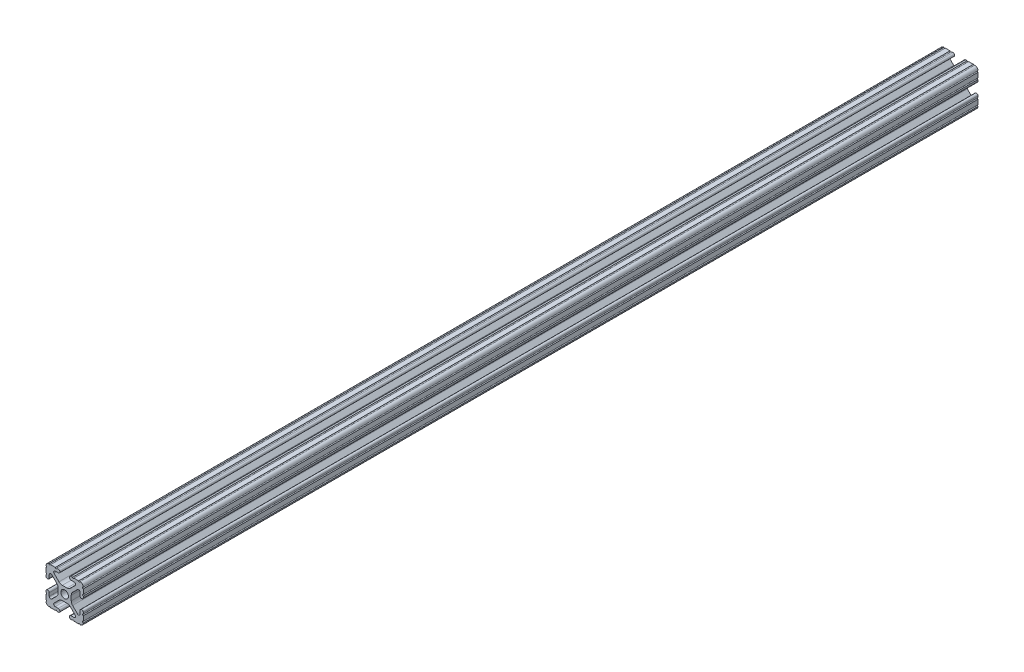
ISO-10303-21;
HEADER;
FILE_DESCRIPTION(('STEP AP214'),'2;1');
FILE_NAME('part.step','',(''),(''),'','','');
FILE_SCHEMA(('AUTOMOTIVE_DESIGN { 1 0 10303 214 1 1 1 1 }'));
ENDSEC;
DATA;
#1=APPLICATION_CONTEXT('core data for automotive mechanical design processes');
#2=APPLICATION_PROTOCOL_DEFINITION('international standard','automotive_design',2000,#1);
#3=PRODUCT_CONTEXT('',#1,'mechanical');
#4=PRODUCT('Part','Part','',(#3));
#5=PRODUCT_RELATED_PRODUCT_CATEGORY('part','',(#4));
#6=PRODUCT_DEFINITION_FORMATION('','',#4);
#7=PRODUCT_DEFINITION_CONTEXT('part definition',#1,'design');
#8=PRODUCT_DEFINITION('design','',#6,#7);
#9=PRODUCT_DEFINITION_SHAPE('','',#8);
#10=(LENGTH_UNIT() NAMED_UNIT(*) SI_UNIT(.MILLI.,.METRE.));
#11=(NAMED_UNIT(*) PLANE_ANGLE_UNIT() SI_UNIT($,.RADIAN.));
#12=(NAMED_UNIT(*) SI_UNIT($,.STERADIAN.) SOLID_ANGLE_UNIT());
#13=UNCERTAINTY_MEASURE_WITH_UNIT(LENGTH_MEASURE(1.E-05),#10,'distance_accuracy_value','');
#14=(GEOMETRIC_REPRESENTATION_CONTEXT(3) GLOBAL_UNCERTAINTY_ASSIGNED_CONTEXT((#13)) GLOBAL_UNIT_ASSIGNED_CONTEXT((#10,
#11,#12)) REPRESENTATION_CONTEXT('',''));
#15=CARTESIAN_POINT('',(0.,0.,0.));
#16=DIRECTION('',(0.,0.,1.));
#17=DIRECTION('',(1.,0.,0.));
#18=AXIS2_PLACEMENT_3D('',#15,#16,#17);
#19=CARTESIAN_POINT('',(-10.5917999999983,-10.5917999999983,-609.6));
#20=DIRECTION('',(0.,0.,-1.));
#21=DIRECTION('',(0.707106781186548,0.707106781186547,0.));
#22=AXIS2_PLACEMENT_3D('',#19,#20,#21);
#23=CYLINDRICAL_SURFACE('',#22,2.10820000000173);
#24=CARTESIAN_POINT('',(-10.5917999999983,-10.5917999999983,0.));
#25=DIRECTION('',(0.,0.,1.));
#26=DIRECTION('',(1.,0.,0.));
#27=AXIS2_PLACEMENT_3D('',#24,#25,#26);
#28=CIRCLE('',#27,2.10820000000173);
#29=CARTESIAN_POINT('',(-12.699846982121,-10.566399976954,0.));
#30=VERTEX_POINT('',#29);
#31=CARTESIAN_POINT('',(-10.566399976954,-12.699846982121,0.));
#32=VERTEX_POINT('',#31);
#33=EDGE_CURVE('E11',#30,#32,#28,.T.);
#34=ORIENTED_EDGE('',*,*,#33,.F.);
#35=DIRECTION('',(0.,0.,1.));
#36=VECTOR('',#35,1.);
#37=CARTESIAN_POINT('',(-12.699846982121,-10.566399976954,-609.6));
#38=LINE('',#37,#36);
#39=CARTESIAN_POINT('',(-12.699846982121,-10.566399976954,-609.6));
#40=VERTEX_POINT('',#39);
#41=EDGE_CURVE('E25',#40,#30,#38,.T.);
#42=ORIENTED_EDGE('',*,*,#41,.F.);
#43=CARTESIAN_POINT('',(-10.5917999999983,-10.5917999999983,-609.6));
#44=DIRECTION('',(0.,0.,1.));
#45=DIRECTION('',(1.,0.,0.));
#46=AXIS2_PLACEMENT_3D('',#43,#44,#45);
#47=CIRCLE('',#46,2.10820000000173);
#48=CARTESIAN_POINT('',(-10.566399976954,-12.699846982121,-609.6));
#49=VERTEX_POINT('',#48);
#50=EDGE_CURVE('E999',#40,#49,#47,.T.);
#51=ORIENTED_EDGE('',*,*,#50,.T.);
#52=DIRECTION('',(0.,0.,1.));
#53=VECTOR('',#52,1.);
#54=CARTESIAN_POINT('',(-10.566399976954,-12.699846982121,-609.6));
#55=LINE('',#54,#53);
#56=EDGE_CURVE('E995',#49,#32,#55,.T.);
#57=ORIENTED_EDGE('',*,*,#56,.T.);
#58=EDGE_LOOP('',(#34,#42,#51,#57));
#59=FACE_BOUND('',#58,.T.);
#60=ADVANCED_FACE('F17',(#59),#23,.T.);
#61=CARTESIAN_POINT('',(-10.0583999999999,-12.6999999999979,-609.6));
#62=DIRECTION('',(0.,0.,-1.));
#63=DIRECTION('',(-0.000150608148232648,-0.999999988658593,0.));
#64=AXIS2_PLACEMENT_3D('',#61,#62,#63);
#65=CYLINDRICAL_SURFACE('',#64,0.507999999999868);
#66=DIRECTION('',(0.,0.,1.));
#67=VECTOR('',#66,1.);
#68=CARTESIAN_POINT('',(-9.5504,-12.6999999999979,-609.6));
#69=LINE('',#68,#67);
#70=CARTESIAN_POINT('',(-9.5504,-12.6999999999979,-609.6));
#71=VERTEX_POINT('',#70);
#72=CARTESIAN_POINT('',(-9.5504,-12.6999999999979,0.));
#73=VERTEX_POINT('',#72);
#74=EDGE_CURVE('E991',#71,#73,#69,.T.);
#75=ORIENTED_EDGE('',*,*,#74,.T.);
#76=CARTESIAN_POINT('',(-10.0583999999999,-12.6999999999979,0.));
#77=DIRECTION('',(0.,0.,1.));
#78=DIRECTION('',(1.,0.,0.));
#79=AXIS2_PLACEMENT_3D('',#76,#77,#78);
#80=CIRCLE('',#79,0.507999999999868);
#81=EDGE_CURVE('E986',#73,#32,#80,.T.);
#82=ORIENTED_EDGE('',*,*,#81,.T.);
#83=ORIENTED_EDGE('',*,*,#56,.F.);
#84=CARTESIAN_POINT('',(-10.0583999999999,-12.6999999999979,-609.6));
#85=DIRECTION('',(0.,0.,1.));
#86=DIRECTION('',(1.,0.,0.));
#87=AXIS2_PLACEMENT_3D('',#84,#85,#86);
#88=CIRCLE('',#87,0.507999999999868);
#89=EDGE_CURVE('E981',#71,#49,#88,.T.);
#90=ORIENTED_EDGE('',*,*,#89,.F.);
#91=EDGE_LOOP('',(#75,#82,#83,#90));
#92=FACE_BOUND('',#91,.T.);
#93=ADVANCED_FACE('F1010',(#92),#65,.F.);
#94=CARTESIAN_POINT('',(-12.6999999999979,-10.0583999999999,-609.6));
#95=DIRECTION('',(0.,0.,1.));
#96=DIRECTION('',(1.,0.,0.));
#97=AXIS2_PLACEMENT_3D('',#94,#95,#96);
#98=PLANE('',#97);
#99=CARTESIAN_POINT('',(-12.6999999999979,-10.0583999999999,-609.6));
#100=DIRECTION('',(0.,0.,1.));
#101=DIRECTION('',(1.,0.,0.));
#102=AXIS2_PLACEMENT_3D('',#99,#100,#101);
#103=CIRCLE('',#102,0.50799999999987);
#104=CARTESIAN_POINT('',(-12.7,-9.5504,-609.6));
#105=VERTEX_POINT('',#104);
#106=EDGE_CURVE('E977',#40,#105,#103,.T.);
#107=ORIENTED_EDGE('',*,*,#106,.T.);
#108=DIRECTION('',(0.,-1.,0.));
#109=VECTOR('',#108,1.);
#110=CARTESIAN_POINT('',(-12.7,-6.3330836,-609.6));
#111=LINE('',#110,#109);
#112=CARTESIAN_POINT('',(-12.7,-6.3330836,-609.6));
#113=VERTEX_POINT('',#112);
#114=EDGE_CURVE('E538',#113,#105,#111,.T.);
#115=ORIENTED_EDGE('',*,*,#114,.F.);
#116=CARTESIAN_POINT('',(-12.699999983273,-5.8250836,-609.6));
#117=DIRECTION('',(0.,0.,1.));
#118=DIRECTION('',(1.,0.,0.));
#119=AXIS2_PLACEMENT_3D('',#116,#117,#118);
#120=CIRCLE('',#119,0.508);
#121=CARTESIAN_POINT('',(-12.7,-5.3170836,-609.6));
#122=VERTEX_POINT('',#121);
#123=EDGE_CURVE('E970',#113,#122,#120,.T.);
#124=ORIENTED_EDGE('',*,*,#123,.T.);
#125=DIRECTION('',(0.,-1.,0.));
#126=VECTOR('',#125,1.);
#127=CARTESIAN_POINT('',(-12.7,-4.3434,-609.6));
#128=LINE('',#127,#126);
#129=CARTESIAN_POINT('',(-12.7,-4.3434,-609.6));
#130=VERTEX_POINT('',#129);
#131=EDGE_CURVE('E965',#130,#122,#128,.T.);
#132=ORIENTED_EDGE('',*,*,#131,.F.);
#133=CARTESIAN_POINT('',(-11.5951,-4.3434,-609.6));
#134=DIRECTION('',(0.,0.,1.));
#135=DIRECTION('',(1.,0.,0.));
#136=AXIS2_PLACEMENT_3D('',#133,#134,#135);
#137=CIRCLE('',#136,1.1049);
#138=CARTESIAN_POINT('',(-10.4902,-4.3434,-609.6));
#139=VERTEX_POINT('',#138);
#140=EDGE_CURVE('E960',#139,#130,#137,.T.);
#141=ORIENTED_EDGE('',*,*,#140,.F.);
#142=DIRECTION('',(0.,1.,0.));
#143=VECTOR('',#142,1.);
#144=CARTESIAN_POINT('',(-10.4902,-6.47479445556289,-609.6));
#145=LINE('',#144,#143);
#146=CARTESIAN_POINT('',(-10.4902,-6.47479445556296,-609.6));
#147=VERTEX_POINT('',#146);
#148=EDGE_CURVE('E955',#147,#139,#145,.T.);
#149=ORIENTED_EDGE('',*,*,#148,.F.);
#150=CARTESIAN_POINT('',(-9.47420000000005,-6.47479445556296,-609.6));
#151=DIRECTION('',(0.,0.,1.));
#152=DIRECTION('',(1.,0.,0.));
#153=AXIS2_PLACEMENT_3D('',#150,#151,#152);
#154=CIRCLE('',#153,1.01599999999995);
#155=CARTESIAN_POINT('',(-8.75577951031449,-7.1932149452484,-609.6));
#156=VERTEX_POINT('',#155);
#157=EDGE_CURVE('E951',#147,#156,#154,.T.);
#158=ORIENTED_EDGE('',*,*,#157,.T.);
#159=DIRECTION('',(-0.707106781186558,-0.707106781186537,0.));
#160=VECTOR('',#159,1.);
#161=CARTESIAN_POINT('',(-5.4257359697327,-3.86317140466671,-609.6));
#162=LINE('',#161,#160);
#163=CARTESIAN_POINT('',(-5.4257359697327,-3.86317140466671,-609.6));
#164=VERTEX_POINT('',#163);
#165=EDGE_CURVE('E946',#164,#156,#162,.T.);
#166=ORIENTED_EDGE('',*,*,#165,.F.);
#167=CARTESIAN_POINT('',(-7.67080000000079,-1.6181073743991,-609.6));
#168=DIRECTION('',(0.,0.,1.));
#169=DIRECTION('',(1.,0.,0.));
#170=AXIS2_PLACEMENT_3D('',#167,#168,#169);
#171=CIRCLE('',#170,3.17500000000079);
#172=CARTESIAN_POINT('',(-4.4958,-1.6181073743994,-609.6));
#173=VERTEX_POINT('',#172);
#174=EDGE_CURVE('E942',#164,#173,#171,.T.);
#175=ORIENTED_EDGE('',*,*,#174,.T.);
#176=DIRECTION('',(0.,-1.,0.));
#177=VECTOR('',#176,1.);
#178=CARTESIAN_POINT('',(-4.4958,1.6181073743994,-609.6));
#179=LINE('',#178,#177);
#180=CARTESIAN_POINT('',(-4.4958,1.61810737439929,-609.6));
#181=VERTEX_POINT('',#180);
#182=EDGE_CURVE('E937',#181,#173,#179,.T.);
#183=ORIENTED_EDGE('',*,*,#182,.F.);
#184=CARTESIAN_POINT('',(-7.67080000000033,1.61810737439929,-609.6));
#185=DIRECTION('',(0.,0.,1.));
#186=DIRECTION('',(1.,0.,0.));
#187=AXIS2_PLACEMENT_3D('',#184,#185,#186);
#188=CIRCLE('',#187,3.17500000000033);
#189=CARTESIAN_POINT('',(-5.4257359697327,3.86317140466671,-609.6));
#190=VERTEX_POINT('',#189);
#191=EDGE_CURVE('E933',#181,#190,#188,.T.);
#192=ORIENTED_EDGE('',*,*,#191,.T.);
#193=DIRECTION('',(0.707106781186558,-0.707106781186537,0.));
#194=VECTOR('',#193,1.);
#195=CARTESIAN_POINT('',(-8.75577951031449,7.1932149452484,-609.6));
#196=LINE('',#195,#194);
#197=CARTESIAN_POINT('',(-8.75577951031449,7.1932149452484,-609.6));
#198=VERTEX_POINT('',#197);
#199=EDGE_CURVE('E928',#198,#190,#196,.T.);
#200=ORIENTED_EDGE('',*,*,#199,.F.);
#201=CARTESIAN_POINT('',(-9.47420000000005,6.47479445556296,-609.6));
#202=DIRECTION('',(0.,0.,1.));
#203=DIRECTION('',(1.,0.,0.));
#204=AXIS2_PLACEMENT_3D('',#201,#202,#203);
#205=CIRCLE('',#204,1.01599999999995);
#206=CARTESIAN_POINT('',(-10.4902,6.47479445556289,-609.6));
#207=VERTEX_POINT('',#206);
#208=EDGE_CURVE('E924',#198,#207,#205,.T.);
#209=ORIENTED_EDGE('',*,*,#208,.T.);
#210=DIRECTION('',(0.,1.,0.));
#211=VECTOR('',#210,1.);
#212=CARTESIAN_POINT('',(-10.4902,4.3434,-609.6));
#213=LINE('',#212,#211);
#214=CARTESIAN_POINT('',(-10.4902,4.34339999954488,-609.6));
#215=VERTEX_POINT('',#214);
#216=EDGE_CURVE('E919',#215,#207,#213,.T.);
#217=ORIENTED_EDGE('',*,*,#216,.F.);
#218=CARTESIAN_POINT('',(-11.5951,4.3433999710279,-609.6));
#219=DIRECTION('',(0.,0.,1.));
#220=DIRECTION('',(1.,0.,0.));
#221=AXIS2_PLACEMENT_3D('',#218,#219,#220);
#222=CIRCLE('',#221,1.1049);
#223=CARTESIAN_POINT('',(-12.7,4.3434,-609.6));
#224=VERTEX_POINT('',#223);
#225=EDGE_CURVE('E914',#224,#215,#222,.T.);
#226=ORIENTED_EDGE('',*,*,#225,.F.);
#227=DIRECTION('',(0.,-1.,0.));
#228=VECTOR('',#227,1.);
#229=CARTESIAN_POINT('',(-12.7,5.3170836,-609.6));
#230=LINE('',#229,#228);
#231=CARTESIAN_POINT('',(-12.7,5.3170836,-609.6));
#232=VERTEX_POINT('',#231);
#233=EDGE_CURVE('E909',#232,#224,#230,.T.);
#234=ORIENTED_EDGE('',*,*,#233,.F.);
#235=CARTESIAN_POINT('',(-12.699999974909,5.8250836,-609.6));
#236=DIRECTION('',(0.,0.,1.));
#237=DIRECTION('',(1.,0.,0.));
#238=AXIS2_PLACEMENT_3D('',#235,#236,#237);
#239=CIRCLE('',#238,0.508);
#240=CARTESIAN_POINT('',(-12.7,6.3330836,-609.6));
#241=VERTEX_POINT('',#240);
#242=EDGE_CURVE('E905',#232,#241,#239,.T.);
#243=ORIENTED_EDGE('',*,*,#242,.T.);
#244=DIRECTION('',(0.,-1.,0.));
#245=VECTOR('',#244,1.);
#246=CARTESIAN_POINT('',(-12.7,9.5504,-609.6));
#247=LINE('',#246,#245);
#248=CARTESIAN_POINT('',(-12.7000000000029,9.5504,-609.6));
#249=VERTEX_POINT('',#248);
#250=EDGE_CURVE('E900',#249,#241,#247,.T.);
#251=ORIENTED_EDGE('',*,*,#250,.F.);
#252=CARTESIAN_POINT('',(-12.7000000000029,10.0583999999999,-609.6));
#253=DIRECTION('',(0.,0.,1.));
#254=DIRECTION('',(1.,0.,0.));
#255=AXIS2_PLACEMENT_3D('',#252,#253,#254);
#256=CIRCLE('',#255,0.50799999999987);
#257=CARTESIAN_POINT('',(-12.699846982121,10.566399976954,-609.6));
#258=VERTEX_POINT('',#257);
#259=EDGE_CURVE('E896',#249,#258,#256,.T.);
#260=ORIENTED_EDGE('',*,*,#259,.T.);
#261=CARTESIAN_POINT('',(-10.5917999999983,10.5917999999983,-609.6));
#262=DIRECTION('',(0.,0.,1.));
#263=DIRECTION('',(1.,0.,0.));
#264=AXIS2_PLACEMENT_3D('',#261,#262,#263);
#265=CIRCLE('',#264,2.10820000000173);
#266=CARTESIAN_POINT('',(-10.566399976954,12.6998469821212,-609.6));
#267=VERTEX_POINT('',#266);
#268=EDGE_CURVE('E891',#267,#258,#265,.T.);
#269=ORIENTED_EDGE('',*,*,#268,.F.);
#270=CARTESIAN_POINT('',(-10.0583999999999,12.7000000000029,-609.6));
#271=DIRECTION('',(0.,0.,1.));
#272=DIRECTION('',(1.,0.,0.));
#273=AXIS2_PLACEMENT_3D('',#270,#271,#272);
#274=CIRCLE('',#273,0.50799999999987);
#275=CARTESIAN_POINT('',(-9.5504,12.7,-609.6));
#276=VERTEX_POINT('',#275);
#277=EDGE_CURVE('E887',#267,#276,#274,.T.);
#278=ORIENTED_EDGE('',*,*,#277,.T.);
#279=DIRECTION('',(-1.,0.,0.));
#280=VECTOR('',#279,1.);
#281=CARTESIAN_POINT('',(-6.3330836,12.7,-609.6));
#282=LINE('',#281,#280);
#283=CARTESIAN_POINT('',(-6.3330836,12.6999999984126,-609.6));
#284=VERTEX_POINT('',#283);
#285=EDGE_CURVE('E882',#284,#276,#282,.T.);
#286=ORIENTED_EDGE('',*,*,#285,.F.);
#287=CARTESIAN_POINT('',(-5.8250836,12.699999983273,-609.6));
#288=DIRECTION('',(0.,0.,1.));
#289=DIRECTION('',(1.,0.,0.));
#290=AXIS2_PLACEMENT_3D('',#287,#288,#289);
#291=CIRCLE('',#290,0.508);
#292=CARTESIAN_POINT('',(-5.3170836,12.7,-609.6));
#293=VERTEX_POINT('',#292);
#294=EDGE_CURVE('E878',#284,#293,#291,.T.);
#295=ORIENTED_EDGE('',*,*,#294,.T.);
#296=DIRECTION('',(-1.,0.,0.));
#297=VECTOR('',#296,1.);
#298=CARTESIAN_POINT('',(-4.3434,12.7,-609.6));
#299=LINE('',#298,#297);
#300=CARTESIAN_POINT('',(-4.3434,12.7,-609.6));
#301=VERTEX_POINT('',#300);
#302=EDGE_CURVE('E873',#301,#293,#299,.T.);
#303=ORIENTED_EDGE('',*,*,#302,.F.);
#304=CARTESIAN_POINT('',(-4.3434,11.5951,-609.6));
#305=DIRECTION('',(0.,0.,1.));
#306=DIRECTION('',(1.,0.,0.));
#307=AXIS2_PLACEMENT_3D('',#304,#305,#306);
#308=CIRCLE('',#307,1.1049);
#309=CARTESIAN_POINT('',(-4.3434,10.4902,-609.6));
#310=VERTEX_POINT('',#309);
#311=EDGE_CURVE('E868',#310,#301,#308,.T.);
#312=ORIENTED_EDGE('',*,*,#311,.F.);
#313=DIRECTION('',(1.,0.,0.));
#314=VECTOR('',#313,1.);
#315=CARTESIAN_POINT('',(-6.47479445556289,10.4902,-609.6));
#316=LINE('',#315,#314);
#317=CARTESIAN_POINT('',(-6.47479445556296,10.4902,-609.6));
#318=VERTEX_POINT('',#317);
#319=EDGE_CURVE('E863',#318,#310,#316,.T.);
#320=ORIENTED_EDGE('',*,*,#319,.F.);
#321=CARTESIAN_POINT('',(-6.47479445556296,9.47420000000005,-609.6));
#322=DIRECTION('',(0.,0.,1.));
#323=DIRECTION('',(1.,0.,0.));
#324=AXIS2_PLACEMENT_3D('',#321,#322,#323);
#325=CIRCLE('',#324,1.01599999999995);
#326=CARTESIAN_POINT('',(-7.1932149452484,8.75577951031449,-609.6));
#327=VERTEX_POINT('',#326);
#328=EDGE_CURVE('E859',#318,#327,#325,.T.);
#329=ORIENTED_EDGE('',*,*,#328,.T.);
#330=DIRECTION('',(-0.707106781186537,0.707106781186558,0.));
#331=VECTOR('',#330,1.);
#332=CARTESIAN_POINT('',(-3.86317140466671,5.4257359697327,-609.6));
#333=LINE('',#332,#331);
#334=CARTESIAN_POINT('',(-3.86317140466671,5.4257359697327,-609.6));
#335=VERTEX_POINT('',#334);
#336=EDGE_CURVE('E854',#335,#327,#333,.T.);
#337=ORIENTED_EDGE('',*,*,#336,.F.);
#338=CARTESIAN_POINT('',(-1.6181073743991,7.67080000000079,-609.6));
#339=DIRECTION('',(0.,0.,1.));
#340=DIRECTION('',(1.,0.,0.));
#341=AXIS2_PLACEMENT_3D('',#338,#339,#340);
#342=CIRCLE('',#341,3.17500000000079);
#343=CARTESIAN_POINT('',(-1.6181073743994,4.4958,-609.6));
#344=VERTEX_POINT('',#343);
#345=EDGE_CURVE('E850',#335,#344,#342,.T.);
#346=ORIENTED_EDGE('',*,*,#345,.T.);
#347=DIRECTION('',(-1.,0.,0.));
#348=VECTOR('',#347,1.);
#349=CARTESIAN_POINT('',(1.6181073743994,4.4958,-609.6));
#350=LINE('',#349,#348);
#351=CARTESIAN_POINT('',(1.61810737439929,4.4958,-609.6));
#352=VERTEX_POINT('',#351);
#353=EDGE_CURVE('E845',#352,#344,#350,.T.);
#354=ORIENTED_EDGE('',*,*,#353,.F.);
#355=CARTESIAN_POINT('',(1.61810737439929,7.67080000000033,-609.6));
#356=DIRECTION('',(0.,0.,1.));
#357=DIRECTION('',(1.,0.,0.));
#358=AXIS2_PLACEMENT_3D('',#355,#356,#357);
#359=CIRCLE('',#358,3.17500000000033);
#360=CARTESIAN_POINT('',(3.86317140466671,5.4257359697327,-609.6));
#361=VERTEX_POINT('',#360);
#362=EDGE_CURVE('E841',#352,#361,#359,.T.);
#363=ORIENTED_EDGE('',*,*,#362,.T.);
#364=DIRECTION('',(-0.707106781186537,-0.707106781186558,0.));
#365=VECTOR('',#364,1.);
#366=CARTESIAN_POINT('',(7.1932149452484,8.75577951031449,-609.6));
#367=LINE('',#366,#365);
#368=CARTESIAN_POINT('',(7.1932149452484,8.75577951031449,-609.6));
#369=VERTEX_POINT('',#368);
#370=EDGE_CURVE('E836',#369,#361,#367,.T.);
#371=ORIENTED_EDGE('',*,*,#370,.F.);
#372=CARTESIAN_POINT('',(6.47479445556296,9.47420000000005,-609.6));
#373=DIRECTION('',(0.,0.,1.));
#374=DIRECTION('',(1.,0.,0.));
#375=AXIS2_PLACEMENT_3D('',#372,#373,#374);
#376=CIRCLE('',#375,1.01599999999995);
#377=CARTESIAN_POINT('',(6.47479445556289,10.4902,-609.6));
#378=VERTEX_POINT('',#377);
#379=EDGE_CURVE('E832',#369,#378,#376,.T.);
#380=ORIENTED_EDGE('',*,*,#379,.T.);
#381=DIRECTION('',(1.,0.,0.));
#382=VECTOR('',#381,1.);
#383=CARTESIAN_POINT('',(4.3434,10.4902,-609.6));
#384=LINE('',#383,#382);
#385=CARTESIAN_POINT('',(4.3434,10.4902,-609.6));
#386=VERTEX_POINT('',#385);
#387=EDGE_CURVE('E827',#386,#378,#384,.T.);
#388=ORIENTED_EDGE('',*,*,#387,.F.);
#389=CARTESIAN_POINT('',(4.3433999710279,11.5951,-609.6));
#390=DIRECTION('',(0.,0.,1.));
#391=DIRECTION('',(1.,0.,0.));
#392=AXIS2_PLACEMENT_3D('',#389,#390,#391);
#393=CIRCLE('',#392,1.1049);
#394=CARTESIAN_POINT('',(4.3434,12.7,-609.6));
#395=VERTEX_POINT('',#394);
#396=EDGE_CURVE('E822',#395,#386,#393,.T.);
#397=ORIENTED_EDGE('',*,*,#396,.F.);
#398=DIRECTION('',(-1.,0.,0.));
#399=VECTOR('',#398,1.);
#400=CARTESIAN_POINT('',(5.3170836,12.7,-609.6));
#401=LINE('',#400,#399);
#402=CARTESIAN_POINT('',(5.3170836,12.7,-609.6));
#403=VERTEX_POINT('',#402);
#404=EDGE_CURVE('E817',#403,#395,#401,.T.);
#405=ORIENTED_EDGE('',*,*,#404,.F.);
#406=CARTESIAN_POINT('',(5.8250836,12.7,-609.6));
#407=DIRECTION('',(0.,0.,1.));
#408=DIRECTION('',(1.,0.,0.));
#409=AXIS2_PLACEMENT_3D('',#406,#407,#408);
#410=CIRCLE('',#409,0.508);
#411=CARTESIAN_POINT('',(6.3330836,12.7,-609.6));
#412=VERTEX_POINT('',#411);
#413=EDGE_CURVE('E813',#403,#412,#410,.T.);
#414=ORIENTED_EDGE('',*,*,#413,.T.);
#415=DIRECTION('',(-1.,0.,0.));
#416=VECTOR('',#415,1.);
#417=CARTESIAN_POINT('',(9.5504,12.7,-609.6));
#418=LINE('',#417,#416);
#419=CARTESIAN_POINT('',(9.5504,12.6999999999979,-609.6));
#420=VERTEX_POINT('',#419);
#421=EDGE_CURVE('E808',#420,#412,#418,.T.);
#422=ORIENTED_EDGE('',*,*,#421,.F.);
#423=CARTESIAN_POINT('',(10.0583999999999,12.6999999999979,-609.6));
#424=DIRECTION('',(0.,0.,1.));
#425=DIRECTION('',(1.,0.,0.));
#426=AXIS2_PLACEMENT_3D('',#423,#424,#425);
#427=CIRCLE('',#426,0.507999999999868);
#428=CARTESIAN_POINT('',(10.566399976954,12.699846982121,-609.6));
#429=VERTEX_POINT('',#428);
#430=EDGE_CURVE('E804',#420,#429,#427,.T.);
#431=ORIENTED_EDGE('',*,*,#430,.T.);
#432=CARTESIAN_POINT('',(10.5917999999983,10.5917999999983,-609.6));
#433=DIRECTION('',(0.,0.,1.));
#434=DIRECTION('',(1.,0.,0.));
#435=AXIS2_PLACEMENT_3D('',#432,#433,#434);
#436=CIRCLE('',#435,2.10820000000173);
#437=CARTESIAN_POINT('',(12.699846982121,10.566399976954,-609.6));
#438=VERTEX_POINT('',#437);
#439=EDGE_CURVE('E799',#438,#429,#436,.T.);
#440=ORIENTED_EDGE('',*,*,#439,.F.);
#441=CARTESIAN_POINT('',(12.7000000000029,10.0583999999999,-609.6));
#442=DIRECTION('',(0.,0.,1.));
#443=DIRECTION('',(1.,0.,0.));
#444=AXIS2_PLACEMENT_3D('',#441,#442,#443);
#445=CIRCLE('',#444,0.50799999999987);
#446=CARTESIAN_POINT('',(12.7,9.5504,-609.6));
#447=VERTEX_POINT('',#446);
#448=EDGE_CURVE('E795',#438,#447,#445,.T.);
#449=ORIENTED_EDGE('',*,*,#448,.T.);
#450=DIRECTION('',(0.,1.,0.));
#451=VECTOR('',#450,1.);
#452=CARTESIAN_POINT('',(12.7,6.3330836,-609.6));
#453=LINE('',#452,#451);
#454=CARTESIAN_POINT('',(12.7,6.3330836,-609.6));
#455=VERTEX_POINT('',#454);
#456=EDGE_CURVE('E790',#455,#447,#453,.T.);
#457=ORIENTED_EDGE('',*,*,#456,.F.);
#458=CARTESIAN_POINT('',(12.699999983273,5.8250836,-609.6));
#459=DIRECTION('',(0.,0.,1.));
#460=DIRECTION('',(1.,0.,0.));
#461=AXIS2_PLACEMENT_3D('',#458,#459,#460);
#462=CIRCLE('',#461,0.508);
#463=CARTESIAN_POINT('',(12.7,5.3170836,-609.6));
#464=VERTEX_POINT('',#463);
#465=EDGE_CURVE('E786',#455,#464,#462,.T.);
#466=ORIENTED_EDGE('',*,*,#465,.T.);
#467=DIRECTION('',(0.,1.,0.));
#468=VECTOR('',#467,1.);
#469=CARTESIAN_POINT('',(12.7,4.3434,-609.6));
#470=LINE('',#469,#468);
#471=CARTESIAN_POINT('',(12.7,4.3434,-609.6));
#472=VERTEX_POINT('',#471);
#473=EDGE_CURVE('E781',#472,#464,#470,.T.);
#474=ORIENTED_EDGE('',*,*,#473,.F.);
#475=CARTESIAN_POINT('',(11.5951,4.3434,-609.6));
#476=DIRECTION('',(0.,0.,1.));
#477=DIRECTION('',(1.,0.,0.));
#478=AXIS2_PLACEMENT_3D('',#475,#476,#477);
#479=CIRCLE('',#478,1.1049);
#480=CARTESIAN_POINT('',(10.4902,4.3434,-609.6));
#481=VERTEX_POINT('',#480);
#482=EDGE_CURVE('E776',#481,#472,#479,.T.);
#483=ORIENTED_EDGE('',*,*,#482,.F.);
#484=DIRECTION('',(0.,-1.,0.));
#485=VECTOR('',#484,1.);
#486=CARTESIAN_POINT('',(10.4902,6.47479445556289,-609.6));
#487=LINE('',#486,#485);
#488=CARTESIAN_POINT('',(10.4902,6.47479445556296,-609.6));
#489=VERTEX_POINT('',#488);
#490=EDGE_CURVE('E771',#489,#481,#487,.T.);
#491=ORIENTED_EDGE('',*,*,#490,.F.);
#492=CARTESIAN_POINT('',(9.47420000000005,6.47479445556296,-609.6));
#493=DIRECTION('',(0.,0.,1.));
#494=DIRECTION('',(1.,0.,0.));
#495=AXIS2_PLACEMENT_3D('',#492,#493,#494);
#496=CIRCLE('',#495,1.01599999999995);
#497=CARTESIAN_POINT('',(8.75577951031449,7.1932149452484,-609.6));
#498=VERTEX_POINT('',#497);
#499=EDGE_CURVE('E767',#489,#498,#496,.T.);
#500=ORIENTED_EDGE('',*,*,#499,.T.);
#501=DIRECTION('',(0.707106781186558,0.707106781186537,0.));
#502=VECTOR('',#501,1.);
#503=CARTESIAN_POINT('',(5.4257359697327,3.86317140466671,-609.6));
#504=LINE('',#503,#502);
#505=CARTESIAN_POINT('',(5.4257359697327,3.86317140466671,-609.6));
#506=VERTEX_POINT('',#505);
#507=EDGE_CURVE('E762',#506,#498,#504,.T.);
#508=ORIENTED_EDGE('',*,*,#507,.F.);
#509=CARTESIAN_POINT('',(7.67080000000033,1.61810737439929,-609.6));
#510=DIRECTION('',(0.,0.,1.));
#511=DIRECTION('',(1.,0.,0.));
#512=AXIS2_PLACEMENT_3D('',#509,#510,#511);
#513=CIRCLE('',#512,3.1750000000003);
#514=CARTESIAN_POINT('',(4.4958,1.6181073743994,-609.6));
#515=VERTEX_POINT('',#514);
#516=EDGE_CURVE('E758',#506,#515,#513,.T.);
#517=ORIENTED_EDGE('',*,*,#516,.T.);
#518=DIRECTION('',(0.,1.,0.));
#519=VECTOR('',#518,1.);
#520=CARTESIAN_POINT('',(4.4958,-1.6181073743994,-609.6));
#521=LINE('',#520,#519);
#522=CARTESIAN_POINT('',(4.4958,-1.61810737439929,-609.6));
#523=VERTEX_POINT('',#522);
#524=EDGE_CURVE('E753',#523,#515,#521,.T.);
#525=ORIENTED_EDGE('',*,*,#524,.F.);
#526=CARTESIAN_POINT('',(7.67080000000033,-1.61810737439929,-609.6));
#527=DIRECTION('',(0.,0.,1.));
#528=DIRECTION('',(1.,0.,0.));
#529=AXIS2_PLACEMENT_3D('',#526,#527,#528);
#530=CIRCLE('',#529,3.17500000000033);
#531=CARTESIAN_POINT('',(5.4257359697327,-3.86317140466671,-609.6));
#532=VERTEX_POINT('',#531);
#533=EDGE_CURVE('E749',#523,#532,#530,.T.);
#534=ORIENTED_EDGE('',*,*,#533,.T.);
#535=DIRECTION('',(-0.707106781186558,0.707106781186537,0.));
#536=VECTOR('',#535,1.);
#537=CARTESIAN_POINT('',(8.75577951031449,-7.1932149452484,-609.6));
#538=LINE('',#537,#536);
#539=CARTESIAN_POINT('',(8.75577951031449,-7.1932149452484,-609.6));
#540=VERTEX_POINT('',#539);
#541=EDGE_CURVE('E744',#540,#532,#538,.T.);
#542=ORIENTED_EDGE('',*,*,#541,.F.);
#543=CARTESIAN_POINT('',(9.47420000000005,-6.47479445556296,-609.6));
#544=DIRECTION('',(0.,0.,1.));
#545=DIRECTION('',(1.,0.,0.));
#546=AXIS2_PLACEMENT_3D('',#543,#544,#545);
#547=CIRCLE('',#546,1.01599999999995);
#548=CARTESIAN_POINT('',(10.4902,-6.47479445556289,-609.6));
#549=VERTEX_POINT('',#548);
#550=EDGE_CURVE('E740',#540,#549,#547,.T.);
#551=ORIENTED_EDGE('',*,*,#550,.T.);
#552=DIRECTION('',(0.,-1.,0.));
#553=VECTOR('',#552,1.);
#554=CARTESIAN_POINT('',(10.4902,-4.3434,-609.6));
#555=LINE('',#554,#553);
#556=CARTESIAN_POINT('',(10.4902,-4.34339999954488,-609.6));
#557=VERTEX_POINT('',#556);
#558=EDGE_CURVE('E735',#557,#549,#555,.T.);
#559=ORIENTED_EDGE('',*,*,#558,.F.);
#560=CARTESIAN_POINT('',(11.5951,-4.3433999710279,-609.6));
#561=DIRECTION('',(0.,0.,1.));
#562=DIRECTION('',(1.,0.,0.));
#563=AXIS2_PLACEMENT_3D('',#560,#561,#562);
#564=CIRCLE('',#563,1.1049);
#565=CARTESIAN_POINT('',(12.7,-4.3434,-609.6));
#566=VERTEX_POINT('',#565);
#567=EDGE_CURVE('E730',#566,#557,#564,.T.);
#568=ORIENTED_EDGE('',*,*,#567,.F.);
#569=DIRECTION('',(0.,1.,0.));
#570=VECTOR('',#569,1.);
#571=CARTESIAN_POINT('',(12.7,-5.3170836,-609.6));
#572=LINE('',#571,#570);
#573=CARTESIAN_POINT('',(12.7,-5.3170836,-609.6));
#574=VERTEX_POINT('',#573);
#575=EDGE_CURVE('E725',#574,#566,#572,.T.);
#576=ORIENTED_EDGE('',*,*,#575,.F.);
#577=CARTESIAN_POINT('',(12.699999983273,-5.8250836,-609.6));
#578=DIRECTION('',(0.,0.,1.));
#579=DIRECTION('',(1.,0.,0.));
#580=AXIS2_PLACEMENT_3D('',#577,#578,#579);
#581=CIRCLE('',#580,0.508);
#582=CARTESIAN_POINT('',(12.7,-6.3330836,-609.6));
#583=VERTEX_POINT('',#582);
#584=EDGE_CURVE('E721',#574,#583,#581,.T.);
#585=ORIENTED_EDGE('',*,*,#584,.T.);
#586=DIRECTION('',(0.,1.,0.));
#587=VECTOR('',#586,1.);
#588=CARTESIAN_POINT('',(12.7,-9.5504,-609.6));
#589=LINE('',#588,#587);
#590=CARTESIAN_POINT('',(12.6999999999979,-9.5504,-609.6));
#591=VERTEX_POINT('',#590);
#592=EDGE_CURVE('E716',#591,#583,#589,.T.);
#593=ORIENTED_EDGE('',*,*,#592,.F.);
#594=CARTESIAN_POINT('',(12.6999999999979,-10.0583999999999,-609.6));
#595=DIRECTION('',(0.,0.,1.));
#596=DIRECTION('',(1.,0.,0.));
#597=AXIS2_PLACEMENT_3D('',#594,#595,#596);
#598=CIRCLE('',#597,0.507999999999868);
#599=CARTESIAN_POINT('',(12.699846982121,-10.566399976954,-609.6));
#600=VERTEX_POINT('',#599);
#601=EDGE_CURVE('E712',#591,#600,#598,.T.);
#602=ORIENTED_EDGE('',*,*,#601,.T.);
#603=CARTESIAN_POINT('',(10.5917999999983,-10.5917999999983,-609.6));
#604=DIRECTION('',(0.,0.,1.));
#605=DIRECTION('',(1.,0.,0.));
#606=AXIS2_PLACEMENT_3D('',#603,#604,#605);
#607=CIRCLE('',#606,2.10820000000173);
#608=CARTESIAN_POINT('',(10.566399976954,-12.6998469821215,-609.6));
#609=VERTEX_POINT('',#608);
#610=EDGE_CURVE('E707',#609,#600,#607,.T.);
#611=ORIENTED_EDGE('',*,*,#610,.F.);
#612=CARTESIAN_POINT('',(10.0583999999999,-12.6999999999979,-609.6));
#613=DIRECTION('',(0.,0.,1.));
#614=DIRECTION('',(1.,0.,0.));
#615=AXIS2_PLACEMENT_3D('',#612,#613,#614);
#616=CIRCLE('',#615,0.50799999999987);
#617=CARTESIAN_POINT('',(9.5504,-12.7,-609.6));
#618=VERTEX_POINT('',#617);
#619=EDGE_CURVE('E703',#609,#618,#616,.T.);
#620=ORIENTED_EDGE('',*,*,#619,.T.);
#621=DIRECTION('',(1.,0.,0.));
#622=VECTOR('',#621,1.);
#623=CARTESIAN_POINT('',(6.3330836,-12.7,-609.6));
#624=LINE('',#623,#622);
#625=CARTESIAN_POINT('',(6.33308359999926,-12.6999991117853,-609.6));
#626=VERTEX_POINT('',#625);
#627=EDGE_CURVE('E698',#626,#618,#624,.T.);
#628=ORIENTED_EDGE('',*,*,#627,.F.);
#629=CARTESIAN_POINT('',(5.8250836,-12.699999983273,-609.6));
#630=DIRECTION('',(0.,0.,1.));
#631=DIRECTION('',(1.,0.,0.));
#632=AXIS2_PLACEMENT_3D('',#629,#630,#631);
#633=CIRCLE('',#632,0.508);
#634=CARTESIAN_POINT('',(5.3170836,-12.7,-609.6));
#635=VERTEX_POINT('',#634);
#636=EDGE_CURVE('E694',#626,#635,#633,.T.);
#637=ORIENTED_EDGE('',*,*,#636,.T.);
#638=DIRECTION('',(1.,0.,0.));
#639=VECTOR('',#638,1.);
#640=CARTESIAN_POINT('',(4.3434,-12.7,-609.6));
#641=LINE('',#640,#639);
#642=CARTESIAN_POINT('',(4.3434,-12.7,-609.6));
#643=VERTEX_POINT('',#642);
#644=EDGE_CURVE('E689',#643,#635,#641,.T.);
#645=ORIENTED_EDGE('',*,*,#644,.F.);
#646=CARTESIAN_POINT('',(4.3434,-11.5951,-609.6));
#647=DIRECTION('',(0.,0.,1.));
#648=DIRECTION('',(1.,0.,0.));
#649=AXIS2_PLACEMENT_3D('',#646,#647,#648);
#650=CIRCLE('',#649,1.1049);
#651=CARTESIAN_POINT('',(4.3434,-10.4902,-609.6));
#652=VERTEX_POINT('',#651);
#653=EDGE_CURVE('E684',#652,#643,#650,.T.);
#654=ORIENTED_EDGE('',*,*,#653,.F.);
#655=DIRECTION('',(-1.,0.,0.));
#656=VECTOR('',#655,1.);
#657=CARTESIAN_POINT('',(6.47479445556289,-10.4902,-609.6));
#658=LINE('',#657,#656);
#659=CARTESIAN_POINT('',(6.47479445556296,-10.4902,-609.6));
#660=VERTEX_POINT('',#659);
#661=EDGE_CURVE('E679',#660,#652,#658,.T.);
#662=ORIENTED_EDGE('',*,*,#661,.F.);
#663=CARTESIAN_POINT('',(6.47479445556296,-9.47420000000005,-609.6));
#664=DIRECTION('',(0.,0.,1.));
#665=DIRECTION('',(1.,0.,0.));
#666=AXIS2_PLACEMENT_3D('',#663,#664,#665);
#667=CIRCLE('',#666,1.01599999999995);
#668=CARTESIAN_POINT('',(7.1932149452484,-8.75577951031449,-609.6));
#669=VERTEX_POINT('',#668);
#670=EDGE_CURVE('E675',#660,#669,#667,.T.);
#671=ORIENTED_EDGE('',*,*,#670,.T.);
#672=DIRECTION('',(0.707106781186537,-0.707106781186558,0.));
#673=VECTOR('',#672,1.);
#674=CARTESIAN_POINT('',(3.86317140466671,-5.4257359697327,-609.6));
#675=LINE('',#674,#673);
#676=CARTESIAN_POINT('',(3.86317140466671,-5.4257359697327,-609.6));
#677=VERTEX_POINT('',#676);
#678=EDGE_CURVE('E670',#677,#669,#675,.T.);
#679=ORIENTED_EDGE('',*,*,#678,.F.);
#680=CARTESIAN_POINT('',(1.61810737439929,-7.67080000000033,-609.6));
#681=DIRECTION('',(0.,0.,1.));
#682=DIRECTION('',(1.,0.,0.));
#683=AXIS2_PLACEMENT_3D('',#680,#681,#682);
#684=CIRCLE('',#683,3.1750000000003);
#685=CARTESIAN_POINT('',(1.6181073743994,-4.4958,-609.6));
#686=VERTEX_POINT('',#685);
#687=EDGE_CURVE('E666',#677,#686,#684,.T.);
#688=ORIENTED_EDGE('',*,*,#687,.T.);
#689=DIRECTION('',(1.,0.,0.));
#690=VECTOR('',#689,1.);
#691=CARTESIAN_POINT('',(-1.6181073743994,-4.4958,-609.6));
#692=LINE('',#691,#690);
#693=CARTESIAN_POINT('',(-1.61810737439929,-4.4958,-609.6));
#694=VERTEX_POINT('',#693);
#695=EDGE_CURVE('E661',#694,#686,#692,.T.);
#696=ORIENTED_EDGE('',*,*,#695,.F.);
#697=CARTESIAN_POINT('',(-1.61810737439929,-7.67080000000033,-609.6));
#698=DIRECTION('',(0.,0.,1.));
#699=DIRECTION('',(1.,0.,0.));
#700=AXIS2_PLACEMENT_3D('',#697,#698,#699);
#701=CIRCLE('',#700,3.17500000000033);
#702=CARTESIAN_POINT('',(-3.86317140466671,-5.4257359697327,-609.6));
#703=VERTEX_POINT('',#702);
#704=EDGE_CURVE('E657',#694,#703,#701,.T.);
#705=ORIENTED_EDGE('',*,*,#704,.T.);
#706=DIRECTION('',(0.707106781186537,0.707106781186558,0.));
#707=VECTOR('',#706,1.);
#708=CARTESIAN_POINT('',(-7.1932149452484,-8.75577951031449,-609.6));
#709=LINE('',#708,#707);
#710=CARTESIAN_POINT('',(-7.1932149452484,-8.75577951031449,-609.6));
#711=VERTEX_POINT('',#710);
#712=EDGE_CURVE('E652',#711,#703,#709,.T.);
#713=ORIENTED_EDGE('',*,*,#712,.F.);
#714=CARTESIAN_POINT('',(-6.47479445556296,-9.47420000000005,-609.6));
#715=DIRECTION('',(0.,0.,1.));
#716=DIRECTION('',(1.,0.,0.));
#717=AXIS2_PLACEMENT_3D('',#714,#715,#716);
#718=CIRCLE('',#717,1.01599999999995);
#719=CARTESIAN_POINT('',(-6.47479445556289,-10.4902,-609.6));
#720=VERTEX_POINT('',#719);
#721=EDGE_CURVE('E648',#711,#720,#718,.T.);
#722=ORIENTED_EDGE('',*,*,#721,.T.);
#723=DIRECTION('',(-1.,0.,0.));
#724=VECTOR('',#723,1.);
#725=CARTESIAN_POINT('',(-4.3434,-10.4902,-609.6));
#726=LINE('',#725,#724);
#727=CARTESIAN_POINT('',(-4.3434,-10.4902,-609.6));
#728=VERTEX_POINT('',#727);
#729=EDGE_CURVE('E643',#728,#720,#726,.T.);
#730=ORIENTED_EDGE('',*,*,#729,.F.);
#731=CARTESIAN_POINT('',(-4.3433999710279,-11.5951,-609.6));
#732=DIRECTION('',(0.,0.,1.));
#733=DIRECTION('',(1.,0.,0.));
#734=AXIS2_PLACEMENT_3D('',#731,#732,#733);
#735=CIRCLE('',#734,1.1049);
#736=CARTESIAN_POINT('',(-4.3434,-12.7,-609.6));
#737=VERTEX_POINT('',#736);
#738=EDGE_CURVE('E638',#737,#728,#735,.T.);
#739=ORIENTED_EDGE('',*,*,#738,.F.);
#740=DIRECTION('',(1.,0.,0.));
#741=VECTOR('',#740,1.);
#742=CARTESIAN_POINT('',(-5.3170836,-12.7,-609.6));
#743=LINE('',#742,#741);
#744=CARTESIAN_POINT('',(-5.31708360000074,-12.6999991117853,-609.6));
#745=VERTEX_POINT('',#744);
#746=EDGE_CURVE('E633',#745,#737,#743,.T.);
#747=ORIENTED_EDGE('',*,*,#746,.F.);
#748=CARTESIAN_POINT('',(-5.8250836,-12.699999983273,-609.6));
#749=DIRECTION('',(0.,0.,1.));
#750=DIRECTION('',(1.,0.,0.));
#751=AXIS2_PLACEMENT_3D('',#748,#749,#750);
#752=CIRCLE('',#751,0.508);
#753=CARTESIAN_POINT('',(-6.3330836,-12.7,-609.6));
#754=VERTEX_POINT('',#753);
#755=EDGE_CURVE('E629',#745,#754,#752,.T.);
#756=ORIENTED_EDGE('',*,*,#755,.T.);
#757=DIRECTION('',(1.,0.,0.));
#758=VECTOR('',#757,1.);
#759=CARTESIAN_POINT('',(-9.5504,-12.7,-609.6));
#760=LINE('',#759,#758);
#761=EDGE_CURVE('E624',#71,#754,#760,.T.);
#762=ORIENTED_EDGE('',*,*,#761,.F.);
#763=ORIENTED_EDGE('',*,*,#89,.T.);
#764=ORIENTED_EDGE('',*,*,#50,.F.);
#765=EDGE_LOOP('',(#107,#115,#124,#132,#141,#149,#158,#166,#175,#183,#192,#200,#209,#217,#226,
#234,#243,#251,#260,#269,#278,#286,#295,#303,#312,#320,#329,#337,#346,#354,#363,#371,#380,#388,
#397,#405,#414,#422,#431,#440,#449,#457,#466,#474,#483,#491,#500,#508,#517,#525,#534,#542,#551,
#559,#568,#576,#585,#593,#602,#611,#620,#628,#637,#645,#654,#662,#671,#679,#688,#696,#705,#713,
#722,#730,#739,#747,#756,#762,#763,#764));
#766=FACE_BOUND('',#765,.T.);
#767=CARTESIAN_POINT('',(0.,0.,-609.6));
#768=DIRECTION('',(0.,0.,1.));
#769=DIRECTION('',(1.,0.,0.));
#770=AXIS2_PLACEMENT_3D('',#767,#768,#769);
#771=CIRCLE('',#770,2.6035);
#772=CARTESIAN_POINT('',(2.6035,0.,-609.6));
#773=VERTEX_POINT('',#772);
#774=CARTESIAN_POINT('',(-2.6035,0.,-609.6));
#775=VERTEX_POINT('',#774);
#776=EDGE_CURVE('E620',#773,#775,#771,.T.);
#777=ORIENTED_EDGE('',*,*,#776,.T.);
#778=CARTESIAN_POINT('',(0.,0.,-609.6));
#779=DIRECTION('',(0.,0.,1.));
#780=DIRECTION('',(1.,0.,0.));
#781=AXIS2_PLACEMENT_3D('',#778,#779,#780);
#782=CIRCLE('',#781,2.6035);
#783=EDGE_CURVE('E618',#775,#773,#782,.T.);
#784=ORIENTED_EDGE('',*,*,#783,.T.);
#785=EDGE_LOOP('',(#777,#784));
#786=FACE_BOUND('',#785,.T.);
#787=ADVANCED_FACE('F1013',(#766,#786),#98,.F.);
#788=CARTESIAN_POINT('',(0.,0.,-609.6));
#789=DIRECTION('',(0.,0.,-1.));
#790=DIRECTION('',(0.,1.,0.));
#791=AXIS2_PLACEMENT_3D('',#788,#789,#790);
#792=CYLINDRICAL_SURFACE('',#791,2.6035);
#793=ORIENTED_EDGE('',*,*,#783,.F.);
#794=CARTESIAN_POINT('',(-2.6035,0.,0.));
#795=DIRECTION('',(0.,0.,-1.));
#796=VECTOR('',#795,1.);
#797=LINE('',#794,#796);
#798=CARTESIAN_POINT('',(-2.6035,0.,0.));
#799=VERTEX_POINT('',#798);
#800=EDGE_CURVE('E589',#799,#775,#797,.T.);
#801=ORIENTED_EDGE('',*,*,#800,.F.);
#802=CARTESIAN_POINT('',(0.,0.,0.));
#803=DIRECTION('',(0.,0.,1.));
#804=DIRECTION('',(1.,0.,0.));
#805=AXIS2_PLACEMENT_3D('',#802,#803,#804);
#806=CIRCLE('',#805,2.6035);
#807=CARTESIAN_POINT('',(2.6035,0.,0.));
#808=VERTEX_POINT('',#807);
#809=EDGE_CURVE('E605',#799,#808,#806,.T.);
#810=ORIENTED_EDGE('',*,*,#809,.T.);
#811=CARTESIAN_POINT('',(2.6035,0.,0.));
#812=DIRECTION('',(0.,0.,-1.));
#813=VECTOR('',#812,1.);
#814=LINE('',#811,#813);
#815=EDGE_CURVE('E548',#808,#773,#814,.T.);
#816=ORIENTED_EDGE('',*,*,#815,.T.);
#817=EDGE_LOOP('',(#793,#801,#810,#816));
#818=FACE_BOUND('',#817,.T.);
#819=ADVANCED_FACE('F573',(#818),#792,.F.);
#820=CARTESIAN_POINT('',(0.,0.,-609.6));
#821=DIRECTION('',(0.,0.,-1.));
#822=DIRECTION('',(0.,-1.,0.));
#823=AXIS2_PLACEMENT_3D('',#820,#821,#822);
#824=CYLINDRICAL_SURFACE('',#823,2.6035);
#825=CARTESIAN_POINT('',(0.,0.,0.));
#826=DIRECTION('',(0.,0.,1.));
#827=DIRECTION('',(1.,0.,0.));
#828=AXIS2_PLACEMENT_3D('',#825,#826,#827);
#829=CIRCLE('',#828,2.6035);
#830=EDGE_CURVE('E544',#808,#799,#829,.T.);
#831=ORIENTED_EDGE('',*,*,#830,.T.);
#832=ORIENTED_EDGE('',*,*,#800,.T.);
#833=ORIENTED_EDGE('',*,*,#776,.F.);
#834=ORIENTED_EDGE('',*,*,#815,.F.);
#835=EDGE_LOOP('',(#831,#832,#833,#834));
#836=FACE_BOUND('',#835,.T.);
#837=ADVANCED_FACE('F563',(#836),#824,.F.);
#838=CARTESIAN_POINT('',(-12.6999999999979,-10.0583999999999,0.));
#839=DIRECTION('',(0.,0.,1.));
#840=DIRECTION('',(1.,0.,0.));
#841=AXIS2_PLACEMENT_3D('',#838,#839,#840);
#842=PLANE('',#841);
#843=CARTESIAN_POINT('',(-12.6999999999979,-10.0583999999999,0.));
#844=DIRECTION('',(0.,0.,1.));
#845=DIRECTION('',(1.,0.,0.));
#846=AXIS2_PLACEMENT_3D('',#843,#844,#845);
#847=CIRCLE('',#846,0.50799999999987);
#848=CARTESIAN_POINT('',(-12.7,-9.5504,0.));
#849=VERTEX_POINT('',#848);
#850=EDGE_CURVE('E526',#30,#849,#847,.T.);
#851=ORIENTED_EDGE('',*,*,#850,.F.);
#852=ORIENTED_EDGE('',*,*,#33,.T.);
#853=ORIENTED_EDGE('',*,*,#81,.F.);
#854=DIRECTION('',(1.,0.,0.));
#855=VECTOR('',#854,1.);
#856=CARTESIAN_POINT('',(-9.5504,-12.7,0.));
#857=LINE('',#856,#855);
#858=CARTESIAN_POINT('',(-6.3330836,-12.7,0.));
#859=VERTEX_POINT('',#858);
#860=EDGE_CURVE('E545',#73,#859,#857,.T.);
#861=ORIENTED_EDGE('',*,*,#860,.T.);
#862=CARTESIAN_POINT('',(-5.8250836,-12.699999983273,0.));
#863=DIRECTION('',(0.,0.,1.));
#864=DIRECTION('',(1.,0.,0.));
#865=AXIS2_PLACEMENT_3D('',#862,#863,#864);
#866=CIRCLE('',#865,0.508);
#867=CARTESIAN_POINT('',(-5.31708360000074,-12.6999991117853,0.));
#868=VERTEX_POINT('',#867);
#869=EDGE_CURVE('E550',#868,#859,#866,.T.);
#870=ORIENTED_EDGE('',*,*,#869,.F.);
#871=DIRECTION('',(1.,0.,0.));
#872=VECTOR('',#871,1.);
#873=CARTESIAN_POINT('',(-5.3170836,-12.7,0.));
#874=LINE('',#873,#872);
#875=CARTESIAN_POINT('',(-4.3434,-12.7,0.));
#876=VERTEX_POINT('',#875);
#877=EDGE_CURVE('E1030',#868,#876,#874,.T.);
#878=ORIENTED_EDGE('',*,*,#877,.T.);
#879=CARTESIAN_POINT('',(-4.3433999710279,-11.5951,0.));
#880=DIRECTION('',(0.,0.,1.));
#881=DIRECTION('',(1.,0.,0.));
#882=AXIS2_PLACEMENT_3D('',#879,#880,#881);
#883=CIRCLE('',#882,1.1049);
#884=CARTESIAN_POINT('',(-4.3434,-10.4902,0.));
#885=VERTEX_POINT('',#884);
#886=EDGE_CURVE('E1723',#876,#885,#883,.T.);
#887=ORIENTED_EDGE('',*,*,#886,.T.);
#888=DIRECTION('',(-1.,0.,0.));
#889=VECTOR('',#888,1.);
#890=CARTESIAN_POINT('',(-4.3434,-10.4902,0.));
#891=LINE('',#890,#889);
#892=CARTESIAN_POINT('',(-6.47479445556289,-10.4902,0.));
#893=VERTEX_POINT('',#892);
#894=EDGE_CURVE('E1719',#885,#893,#891,.T.);
#895=ORIENTED_EDGE('',*,*,#894,.T.);
#896=CARTESIAN_POINT('',(-6.47479445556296,-9.47420000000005,0.));
#897=DIRECTION('',(0.,0.,1.));
#898=DIRECTION('',(1.,0.,0.));
#899=AXIS2_PLACEMENT_3D('',#896,#897,#898);
#900=CIRCLE('',#899,1.01599999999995);
#901=CARTESIAN_POINT('',(-7.1932149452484,-8.75577951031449,0.));
#902=VERTEX_POINT('',#901);
#903=EDGE_CURVE('E1714',#902,#893,#900,.T.);
#904=ORIENTED_EDGE('',*,*,#903,.F.);
#905=DIRECTION('',(0.707106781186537,0.707106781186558,0.));
#906=VECTOR('',#905,1.);
#907=CARTESIAN_POINT('',(-7.1932149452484,-8.75577951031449,0.));
#908=LINE('',#907,#906);
#909=CARTESIAN_POINT('',(-3.86317140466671,-5.4257359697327,0.));
#910=VERTEX_POINT('',#909);
#911=EDGE_CURVE('E1710',#902,#910,#908,.T.);
#912=ORIENTED_EDGE('',*,*,#911,.T.);
#913=CARTESIAN_POINT('',(-1.61810737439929,-7.67080000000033,0.));
#914=DIRECTION('',(0.,0.,1.));
#915=DIRECTION('',(1.,0.,0.));
#916=AXIS2_PLACEMENT_3D('',#913,#914,#915);
#917=CIRCLE('',#916,3.17500000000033);
#918=CARTESIAN_POINT('',(-1.61810737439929,-4.4958,0.));
#919=VERTEX_POINT('',#918);
#920=EDGE_CURVE('E1705',#919,#910,#917,.T.);
#921=ORIENTED_EDGE('',*,*,#920,.F.);
#922=DIRECTION('',(1.,0.,0.));
#923=VECTOR('',#922,1.);
#924=CARTESIAN_POINT('',(-1.6181073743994,-4.4958,0.));
#925=LINE('',#924,#923);
#926=CARTESIAN_POINT('',(1.6181073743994,-4.4958,0.));
#927=VERTEX_POINT('',#926);
#928=EDGE_CURVE('E1701',#919,#927,#925,.T.);
#929=ORIENTED_EDGE('',*,*,#928,.T.);
#930=CARTESIAN_POINT('',(1.61810737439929,-7.67080000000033,0.));
#931=DIRECTION('',(0.,0.,1.));
#932=DIRECTION('',(1.,0.,0.));
#933=AXIS2_PLACEMENT_3D('',#930,#931,#932);
#934=CIRCLE('',#933,3.1750000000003);
#935=CARTESIAN_POINT('',(3.86317140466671,-5.4257359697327,0.));
#936=VERTEX_POINT('',#935);
#937=EDGE_CURVE('E1696',#936,#927,#934,.T.);
#938=ORIENTED_EDGE('',*,*,#937,.F.);
#939=DIRECTION('',(0.707106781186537,-0.707106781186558,0.));
#940=VECTOR('',#939,1.);
#941=CARTESIAN_POINT('',(3.86317140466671,-5.4257359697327,0.));
#942=LINE('',#941,#940);
#943=CARTESIAN_POINT('',(7.1932149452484,-8.75577951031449,0.));
#944=VERTEX_POINT('',#943);
#945=EDGE_CURVE('E1692',#936,#944,#942,.T.);
#946=ORIENTED_EDGE('',*,*,#945,.T.);
#947=CARTESIAN_POINT('',(6.47479445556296,-9.47420000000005,0.));
#948=DIRECTION('',(0.,0.,1.));
#949=DIRECTION('',(1.,0.,0.));
#950=AXIS2_PLACEMENT_3D('',#947,#948,#949);
#951=CIRCLE('',#950,1.01599999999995);
#952=CARTESIAN_POINT('',(6.47479445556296,-10.4902,0.));
#953=VERTEX_POINT('',#952);
#954=EDGE_CURVE('E1687',#953,#944,#951,.T.);
#955=ORIENTED_EDGE('',*,*,#954,.F.);
#956=DIRECTION('',(-1.,0.,0.));
#957=VECTOR('',#956,1.);
#958=CARTESIAN_POINT('',(6.47479445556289,-10.4902,0.));
#959=LINE('',#958,#957);
#960=CARTESIAN_POINT('',(4.3434,-10.4902,0.));
#961=VERTEX_POINT('',#960);
#962=EDGE_CURVE('E1683',#953,#961,#959,.T.);
#963=ORIENTED_EDGE('',*,*,#962,.T.);
#964=CARTESIAN_POINT('',(4.3434,-11.5951,0.));
#965=DIRECTION('',(0.,0.,1.));
#966=DIRECTION('',(1.,0.,0.));
#967=AXIS2_PLACEMENT_3D('',#964,#965,#966);
#968=CIRCLE('',#967,1.1049);
#969=CARTESIAN_POINT('',(4.3434,-12.7,0.));
#970=VERTEX_POINT('',#969);
#971=EDGE_CURVE('E1679',#961,#970,#968,.T.);
#972=ORIENTED_EDGE('',*,*,#971,.T.);
#973=DIRECTION('',(1.,0.,0.));
#974=VECTOR('',#973,1.);
#975=CARTESIAN_POINT('',(4.3434,-12.7,0.));
#976=LINE('',#975,#974);
#977=CARTESIAN_POINT('',(5.3170836,-12.7,0.));
#978=VERTEX_POINT('',#977);
#979=EDGE_CURVE('E1675',#970,#978,#976,.T.);
#980=ORIENTED_EDGE('',*,*,#979,.T.);
#981=CARTESIAN_POINT('',(5.8250836,-12.699999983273,0.));
#982=DIRECTION('',(0.,0.,1.));
#983=DIRECTION('',(1.,0.,0.));
#984=AXIS2_PLACEMENT_3D('',#981,#982,#983);
#985=CIRCLE('',#984,0.508);
#986=CARTESIAN_POINT('',(6.33308359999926,-12.6999991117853,0.));
#987=VERTEX_POINT('',#986);
#988=EDGE_CURVE('E1670',#987,#978,#985,.T.);
#989=ORIENTED_EDGE('',*,*,#988,.F.);
#990=DIRECTION('',(1.,0.,0.));
#991=VECTOR('',#990,1.);
#992=CARTESIAN_POINT('',(6.3330836,-12.7,0.));
#993=LINE('',#992,#991);
#994=CARTESIAN_POINT('',(9.5504,-12.7,0.));
#995=VERTEX_POINT('',#994);
#996=EDGE_CURVE('E1666',#987,#995,#993,.T.);
#997=ORIENTED_EDGE('',*,*,#996,.T.);
#998=CARTESIAN_POINT('',(10.0583999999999,-12.6999999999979,0.));
#999=DIRECTION('',(0.,0.,1.));
#1000=DIRECTION('',(1.,0.,0.));
#1001=AXIS2_PLACEMENT_3D('',#998,#999,#1000);
#1002=CIRCLE('',#1001,0.50799999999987);
#1003=CARTESIAN_POINT('',(10.566399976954,-12.6998469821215,0.));
#1004=VERTEX_POINT('',#1003);
#1005=EDGE_CURVE('E1661',#1004,#995,#1002,.T.);
#1006=ORIENTED_EDGE('',*,*,#1005,.F.);
#1007=CARTESIAN_POINT('',(10.5917999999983,-10.5917999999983,0.));
#1008=DIRECTION('',(0.,0.,1.));
#1009=DIRECTION('',(1.,0.,0.));
#1010=AXIS2_PLACEMENT_3D('',#1007,#1008,#1009);
#1011=CIRCLE('',#1010,2.10820000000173);
#1012=CARTESIAN_POINT('',(12.699846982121,-10.566399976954,0.));
#1013=VERTEX_POINT('',#1012);
#1014=EDGE_CURVE('E1657',#1004,#1013,#1011,.T.);
#1015=ORIENTED_EDGE('',*,*,#1014,.T.);
#1016=CARTESIAN_POINT('',(12.6999999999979,-10.0583999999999,0.));
#1017=DIRECTION('',(0.,0.,1.));
#1018=DIRECTION('',(1.,0.,0.));
#1019=AXIS2_PLACEMENT_3D('',#1016,#1017,#1018);
#1020=CIRCLE('',#1019,0.507999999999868);
#1021=CARTESIAN_POINT('',(12.6999999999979,-9.5504,0.));
#1022=VERTEX_POINT('',#1021);
#1023=EDGE_CURVE('E1652',#1022,#1013,#1020,.T.);
#1024=ORIENTED_EDGE('',*,*,#1023,.F.);
#1025=DIRECTION('',(0.,1.,0.));
#1026=VECTOR('',#1025,1.);
#1027=CARTESIAN_POINT('',(12.7,-9.5504,0.));
#1028=LINE('',#1027,#1026);
#1029=CARTESIAN_POINT('',(12.7,-6.3330836,0.));
#1030=VERTEX_POINT('',#1029);
#1031=EDGE_CURVE('E1648',#1022,#1030,#1028,.T.);
#1032=ORIENTED_EDGE('',*,*,#1031,.T.);
#1033=CARTESIAN_POINT('',(12.699999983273,-5.8250836,0.));
#1034=DIRECTION('',(0.,0.,1.));
#1035=DIRECTION('',(1.,0.,0.));
#1036=AXIS2_PLACEMENT_3D('',#1033,#1034,#1035);
#1037=CIRCLE('',#1036,0.508);
#1038=CARTESIAN_POINT('',(12.7,-5.3170836,0.));
#1039=VERTEX_POINT('',#1038);
#1040=EDGE_CURVE('E1643',#1039,#1030,#1037,.T.);
#1041=ORIENTED_EDGE('',*,*,#1040,.F.);
#1042=DIRECTION('',(0.,1.,0.));
#1043=VECTOR('',#1042,1.);
#1044=CARTESIAN_POINT('',(12.7,-5.3170836,0.));
#1045=LINE('',#1044,#1043);
#1046=CARTESIAN_POINT('',(12.7,-4.3434,0.));
#1047=VERTEX_POINT('',#1046);
#1048=EDGE_CURVE('E1639',#1039,#1047,#1045,.T.);
#1049=ORIENTED_EDGE('',*,*,#1048,.T.);
#1050=CARTESIAN_POINT('',(11.5951,-4.3433999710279,0.));
#1051=DIRECTION('',(0.,0.,1.));
#1052=DIRECTION('',(1.,0.,0.));
#1053=AXIS2_PLACEMENT_3D('',#1050,#1051,#1052);
#1054=CIRCLE('',#1053,1.1049);
#1055=CARTESIAN_POINT('',(10.4902,-4.34339999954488,0.));
#1056=VERTEX_POINT('',#1055);
#1057=EDGE_CURVE('E1635',#1047,#1056,#1054,.T.);
#1058=ORIENTED_EDGE('',*,*,#1057,.T.);
#1059=DIRECTION('',(0.,-1.,0.));
#1060=VECTOR('',#1059,1.);
#1061=CARTESIAN_POINT('',(10.4902,-4.3434,0.));
#1062=LINE('',#1061,#1060);
#1063=CARTESIAN_POINT('',(10.4902,-6.47479445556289,0.));
#1064=VERTEX_POINT('',#1063);
#1065=EDGE_CURVE('E1631',#1056,#1064,#1062,.T.);
#1066=ORIENTED_EDGE('',*,*,#1065,.T.);
#1067=CARTESIAN_POINT('',(9.47420000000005,-6.47479445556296,0.));
#1068=DIRECTION('',(0.,0.,1.));
#1069=DIRECTION('',(1.,0.,0.));
#1070=AXIS2_PLACEMENT_3D('',#1067,#1068,#1069);
#1071=CIRCLE('',#1070,1.01599999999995);
#1072=CARTESIAN_POINT('',(8.75577951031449,-7.1932149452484,0.));
#1073=VERTEX_POINT('',#1072);
#1074=EDGE_CURVE('E1626',#1073,#1064,#1071,.T.);
#1075=ORIENTED_EDGE('',*,*,#1074,.F.);
#1076=DIRECTION('',(-0.707106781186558,0.707106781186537,0.));
#1077=VECTOR('',#1076,1.);
#1078=CARTESIAN_POINT('',(8.75577951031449,-7.1932149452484,0.));
#1079=LINE('',#1078,#1077);
#1080=CARTESIAN_POINT('',(5.4257359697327,-3.86317140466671,0.));
#1081=VERTEX_POINT('',#1080);
#1082=EDGE_CURVE('E1622',#1073,#1081,#1079,.T.);
#1083=ORIENTED_EDGE('',*,*,#1082,.T.);
#1084=CARTESIAN_POINT('',(7.67080000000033,-1.61810737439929,0.));
#1085=DIRECTION('',(0.,0.,1.));
#1086=DIRECTION('',(1.,0.,0.));
#1087=AXIS2_PLACEMENT_3D('',#1084,#1085,#1086);
#1088=CIRCLE('',#1087,3.17500000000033);
#1089=CARTESIAN_POINT('',(4.4958,-1.61810737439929,0.));
#1090=VERTEX_POINT('',#1089);
#1091=EDGE_CURVE('E1617',#1090,#1081,#1088,.T.);
#1092=ORIENTED_EDGE('',*,*,#1091,.F.);
#1093=DIRECTION('',(0.,1.,0.));
#1094=VECTOR('',#1093,1.);
#1095=CARTESIAN_POINT('',(4.4958,-1.6181073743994,0.));
#1096=LINE('',#1095,#1094);
#1097=CARTESIAN_POINT('',(4.4958,1.6181073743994,0.));
#1098=VERTEX_POINT('',#1097);
#1099=EDGE_CURVE('E1613',#1090,#1098,#1096,.T.);
#1100=ORIENTED_EDGE('',*,*,#1099,.T.);
#1101=CARTESIAN_POINT('',(7.67080000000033,1.61810737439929,0.));
#1102=DIRECTION('',(0.,0.,1.));
#1103=DIRECTION('',(1.,0.,0.));
#1104=AXIS2_PLACEMENT_3D('',#1101,#1102,#1103);
#1105=CIRCLE('',#1104,3.1750000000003);
#1106=CARTESIAN_POINT('',(5.4257359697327,3.86317140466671,0.));
#1107=VERTEX_POINT('',#1106);
#1108=EDGE_CURVE('E1608',#1107,#1098,#1105,.T.);
#1109=ORIENTED_EDGE('',*,*,#1108,.F.);
#1110=DIRECTION('',(0.707106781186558,0.707106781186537,0.));
#1111=VECTOR('',#1110,1.);
#1112=CARTESIAN_POINT('',(5.4257359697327,3.86317140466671,0.));
#1113=LINE('',#1112,#1111);
#1114=CARTESIAN_POINT('',(8.75577951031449,7.1932149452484,0.));
#1115=VERTEX_POINT('',#1114);
#1116=EDGE_CURVE('E1604',#1107,#1115,#1113,.T.);
#1117=ORIENTED_EDGE('',*,*,#1116,.T.);
#1118=CARTESIAN_POINT('',(9.47420000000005,6.47479445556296,0.));
#1119=DIRECTION('',(0.,0.,1.));
#1120=DIRECTION('',(1.,0.,0.));
#1121=AXIS2_PLACEMENT_3D('',#1118,#1119,#1120);
#1122=CIRCLE('',#1121,1.01599999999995);
#1123=CARTESIAN_POINT('',(10.4902,6.47479445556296,0.));
#1124=VERTEX_POINT('',#1123);
#1125=EDGE_CURVE('E1599',#1124,#1115,#1122,.T.);
#1126=ORIENTED_EDGE('',*,*,#1125,.F.);
#1127=DIRECTION('',(0.,-1.,0.));
#1128=VECTOR('',#1127,1.);
#1129=CARTESIAN_POINT('',(10.4902,6.47479445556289,0.));
#1130=LINE('',#1129,#1128);
#1131=CARTESIAN_POINT('',(10.4902,4.3434,0.));
#1132=VERTEX_POINT('',#1131);
#1133=EDGE_CURVE('E1595',#1124,#1132,#1130,.T.);
#1134=ORIENTED_EDGE('',*,*,#1133,.T.);
#1135=CARTESIAN_POINT('',(11.5951,4.3434,0.));
#1136=DIRECTION('',(0.,0.,1.));
#1137=DIRECTION('',(1.,0.,0.));
#1138=AXIS2_PLACEMENT_3D('',#1135,#1136,#1137);
#1139=CIRCLE('',#1138,1.1049);
#1140=CARTESIAN_POINT('',(12.7,4.3434,0.));
#1141=VERTEX_POINT('',#1140);
#1142=EDGE_CURVE('E1591',#1132,#1141,#1139,.T.);
#1143=ORIENTED_EDGE('',*,*,#1142,.T.);
#1144=DIRECTION('',(0.,1.,0.));
#1145=VECTOR('',#1144,1.);
#1146=CARTESIAN_POINT('',(12.7,4.3434,0.));
#1147=LINE('',#1146,#1145);
#1148=CARTESIAN_POINT('',(12.7,5.3170836,0.));
#1149=VERTEX_POINT('',#1148);
#1150=EDGE_CURVE('E1587',#1141,#1149,#1147,.T.);
#1151=ORIENTED_EDGE('',*,*,#1150,.T.);
#1152=CARTESIAN_POINT('',(12.699999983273,5.8250836,0.));
#1153=DIRECTION('',(0.,0.,1.));
#1154=DIRECTION('',(1.,0.,0.));
#1155=AXIS2_PLACEMENT_3D('',#1152,#1153,#1154);
#1156=CIRCLE('',#1155,0.508);
#1157=CARTESIAN_POINT('',(12.7,6.3330836,0.));
#1158=VERTEX_POINT('',#1157);
#1159=EDGE_CURVE('E1582',#1158,#1149,#1156,.T.);
#1160=ORIENTED_EDGE('',*,*,#1159,.F.);
#1161=DIRECTION('',(0.,1.,0.));
#1162=VECTOR('',#1161,1.);
#1163=CARTESIAN_POINT('',(12.7,6.3330836,0.));
#1164=LINE('',#1163,#1162);
#1165=CARTESIAN_POINT('',(12.7,9.5504,0.));
#1166=VERTEX_POINT('',#1165);
#1167=EDGE_CURVE('E1578',#1158,#1166,#1164,.T.);
#1168=ORIENTED_EDGE('',*,*,#1167,.T.);
#1169=CARTESIAN_POINT('',(12.7000000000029,10.0583999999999,0.));
#1170=DIRECTION('',(0.,0.,1.));
#1171=DIRECTION('',(1.,0.,0.));
#1172=AXIS2_PLACEMENT_3D('',#1169,#1170,#1171);
#1173=CIRCLE('',#1172,0.50799999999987);
#1174=CARTESIAN_POINT('',(12.699846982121,10.566399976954,0.));
#1175=VERTEX_POINT('',#1174);
#1176=EDGE_CURVE('E1573',#1175,#1166,#1173,.T.);
#1177=ORIENTED_EDGE('',*,*,#1176,.F.);
#1178=CARTESIAN_POINT('',(10.5917999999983,10.5917999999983,0.));
#1179=DIRECTION('',(0.,0.,1.));
#1180=DIRECTION('',(1.,0.,0.));
#1181=AXIS2_PLACEMENT_3D('',#1178,#1179,#1180);
#1182=CIRCLE('',#1181,2.10820000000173);
#1183=CARTESIAN_POINT('',(10.566399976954,12.699846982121,0.));
#1184=VERTEX_POINT('',#1183);
#1185=EDGE_CURVE('E1569',#1175,#1184,#1182,.T.);
#1186=ORIENTED_EDGE('',*,*,#1185,.T.);
#1187=CARTESIAN_POINT('',(10.0583999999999,12.6999999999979,0.));
#1188=DIRECTION('',(0.,0.,1.));
#1189=DIRECTION('',(1.,0.,0.));
#1190=AXIS2_PLACEMENT_3D('',#1187,#1188,#1189);
#1191=CIRCLE('',#1190,0.507999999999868);
#1192=CARTESIAN_POINT('',(9.5504,12.6999999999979,0.));
#1193=VERTEX_POINT('',#1192);
#1194=EDGE_CURVE('E1564',#1193,#1184,#1191,.T.);
#1195=ORIENTED_EDGE('',*,*,#1194,.F.);
#1196=DIRECTION('',(-1.,0.,0.));
#1197=VECTOR('',#1196,1.);
#1198=CARTESIAN_POINT('',(9.5504,12.7,0.));
#1199=LINE('',#1198,#1197);
#1200=CARTESIAN_POINT('',(6.3330836,12.7,0.));
#1201=VERTEX_POINT('',#1200);
#1202=EDGE_CURVE('E1560',#1193,#1201,#1199,.T.);
#1203=ORIENTED_EDGE('',*,*,#1202,.T.);
#1204=CARTESIAN_POINT('',(5.8250836,12.7,0.));
#1205=DIRECTION('',(0.,0.,1.));
#1206=DIRECTION('',(1.,0.,0.));
#1207=AXIS2_PLACEMENT_3D('',#1204,#1205,#1206);
#1208=CIRCLE('',#1207,0.508);
#1209=CARTESIAN_POINT('',(5.3170836,12.7,0.));
#1210=VERTEX_POINT('',#1209);
#1211=EDGE_CURVE('E1555',#1210,#1201,#1208,.T.);
#1212=ORIENTED_EDGE('',*,*,#1211,.F.);
#1213=DIRECTION('',(-1.,0.,0.));
#1214=VECTOR('',#1213,1.);
#1215=CARTESIAN_POINT('',(5.3170836,12.7,0.));
#1216=LINE('',#1215,#1214);
#1217=CARTESIAN_POINT('',(4.3434,12.7,0.));
#1218=VERTEX_POINT('',#1217);
#1219=EDGE_CURVE('E1551',#1210,#1218,#1216,.T.);
#1220=ORIENTED_EDGE('',*,*,#1219,.T.);
#1221=CARTESIAN_POINT('',(4.3433999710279,11.5951,0.));
#1222=DIRECTION('',(0.,0.,1.));
#1223=DIRECTION('',(1.,0.,0.));
#1224=AXIS2_PLACEMENT_3D('',#1221,#1222,#1223);
#1225=CIRCLE('',#1224,1.1049);
#1226=CARTESIAN_POINT('',(4.3434,10.4902,0.));
#1227=VERTEX_POINT('',#1226);
#1228=EDGE_CURVE('E1547',#1218,#1227,#1225,.T.);
#1229=ORIENTED_EDGE('',*,*,#1228,.T.);
#1230=DIRECTION('',(1.,0.,0.));
#1231=VECTOR('',#1230,1.);
#1232=CARTESIAN_POINT('',(4.3434,10.4902,0.));
#1233=LINE('',#1232,#1231);
#1234=CARTESIAN_POINT('',(6.47479445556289,10.4902,0.));
#1235=VERTEX_POINT('',#1234);
#1236=EDGE_CURVE('E1543',#1227,#1235,#1233,.T.);
#1237=ORIENTED_EDGE('',*,*,#1236,.T.);
#1238=CARTESIAN_POINT('',(6.47479445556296,9.47420000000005,0.));
#1239=DIRECTION('',(0.,0.,1.));
#1240=DIRECTION('',(1.,0.,0.));
#1241=AXIS2_PLACEMENT_3D('',#1238,#1239,#1240);
#1242=CIRCLE('',#1241,1.01599999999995);
#1243=CARTESIAN_POINT('',(7.1932149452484,8.75577951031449,0.));
#1244=VERTEX_POINT('',#1243);
#1245=EDGE_CURVE('E1538',#1244,#1235,#1242,.T.);
#1246=ORIENTED_EDGE('',*,*,#1245,.F.);
#1247=DIRECTION('',(-0.707106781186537,-0.707106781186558,0.));
#1248=VECTOR('',#1247,1.);
#1249=CARTESIAN_POINT('',(7.1932149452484,8.75577951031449,0.));
#1250=LINE('',#1249,#1248);
#1251=CARTESIAN_POINT('',(3.86317140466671,5.4257359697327,0.));
#1252=VERTEX_POINT('',#1251);
#1253=EDGE_CURVE('E1534',#1244,#1252,#1250,.T.);
#1254=ORIENTED_EDGE('',*,*,#1253,.T.);
#1255=CARTESIAN_POINT('',(1.61810737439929,7.67080000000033,0.));
#1256=DIRECTION('',(0.,0.,1.));
#1257=DIRECTION('',(1.,0.,0.));
#1258=AXIS2_PLACEMENT_3D('',#1255,#1256,#1257);
#1259=CIRCLE('',#1258,3.17500000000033);
#1260=CARTESIAN_POINT('',(1.61810737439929,4.4958,0.));
#1261=VERTEX_POINT('',#1260);
#1262=EDGE_CURVE('E1529',#1261,#1252,#1259,.T.);
#1263=ORIENTED_EDGE('',*,*,#1262,.F.);
#1264=DIRECTION('',(-1.,0.,0.));
#1265=VECTOR('',#1264,1.);
#1266=CARTESIAN_POINT('',(1.6181073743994,4.4958,0.));
#1267=LINE('',#1266,#1265);
#1268=CARTESIAN_POINT('',(-1.6181073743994,4.4958,0.));
#1269=VERTEX_POINT('',#1268);
#1270=EDGE_CURVE('E1525',#1261,#1269,#1267,.T.);
#1271=ORIENTED_EDGE('',*,*,#1270,.T.);
#1272=CARTESIAN_POINT('',(-1.6181073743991,7.67080000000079,0.));
#1273=DIRECTION('',(0.,0.,1.));
#1274=DIRECTION('',(1.,0.,0.));
#1275=AXIS2_PLACEMENT_3D('',#1272,#1273,#1274);
#1276=CIRCLE('',#1275,3.17500000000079);
#1277=CARTESIAN_POINT('',(-3.86317140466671,5.4257359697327,0.));
#1278=VERTEX_POINT('',#1277);
#1279=EDGE_CURVE('E1520',#1278,#1269,#1276,.T.);
#1280=ORIENTED_EDGE('',*,*,#1279,.F.);
#1281=DIRECTION('',(-0.707106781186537,0.707106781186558,0.));
#1282=VECTOR('',#1281,1.);
#1283=CARTESIAN_POINT('',(-3.86317140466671,5.4257359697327,0.));
#1284=LINE('',#1283,#1282);
#1285=CARTESIAN_POINT('',(-7.1932149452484,8.75577951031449,0.));
#1286=VERTEX_POINT('',#1285);
#1287=EDGE_CURVE('E1516',#1278,#1286,#1284,.T.);
#1288=ORIENTED_EDGE('',*,*,#1287,.T.);
#1289=CARTESIAN_POINT('',(-6.47479445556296,9.47420000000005,0.));
#1290=DIRECTION('',(0.,0.,1.));
#1291=DIRECTION('',(1.,0.,0.));
#1292=AXIS2_PLACEMENT_3D('',#1289,#1290,#1291);
#1293=CIRCLE('',#1292,1.01599999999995);
#1294=CARTESIAN_POINT('',(-6.47479445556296,10.4902,0.));
#1295=VERTEX_POINT('',#1294);
#1296=EDGE_CURVE('E1511',#1295,#1286,#1293,.T.);
#1297=ORIENTED_EDGE('',*,*,#1296,.F.);
#1298=DIRECTION('',(1.,0.,0.));
#1299=VECTOR('',#1298,1.);
#1300=CARTESIAN_POINT('',(-6.47479445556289,10.4902,0.));
#1301=LINE('',#1300,#1299);
#1302=CARTESIAN_POINT('',(-4.3434,10.4902,0.));
#1303=VERTEX_POINT('',#1302);
#1304=EDGE_CURVE('E1507',#1295,#1303,#1301,.T.);
#1305=ORIENTED_EDGE('',*,*,#1304,.T.);
#1306=CARTESIAN_POINT('',(-4.3434,11.5951,0.));
#1307=DIRECTION('',(0.,0.,1.));
#1308=DIRECTION('',(1.,0.,0.));
#1309=AXIS2_PLACEMENT_3D('',#1306,#1307,#1308);
#1310=CIRCLE('',#1309,1.1049);
#1311=CARTESIAN_POINT('',(-4.3434,12.7,0.));
#1312=VERTEX_POINT('',#1311);
#1313=EDGE_CURVE('E1503',#1303,#1312,#1310,.T.);
#1314=ORIENTED_EDGE('',*,*,#1313,.T.);
#1315=DIRECTION('',(-1.,0.,0.));
#1316=VECTOR('',#1315,1.);
#1317=CARTESIAN_POINT('',(-4.3434,12.7,0.));
#1318=LINE('',#1317,#1316);
#1319=CARTESIAN_POINT('',(-5.3170836,12.7,0.));
#1320=VERTEX_POINT('',#1319);
#1321=EDGE_CURVE('E1499',#1312,#1320,#1318,.T.);
#1322=ORIENTED_EDGE('',*,*,#1321,.T.);
#1323=CARTESIAN_POINT('',(-5.8250836,12.699999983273,0.));
#1324=DIRECTION('',(0.,0.,1.));
#1325=DIRECTION('',(1.,0.,0.));
#1326=AXIS2_PLACEMENT_3D('',#1323,#1324,#1325);
#1327=CIRCLE('',#1326,0.508);
#1328=CARTESIAN_POINT('',(-6.3330836,12.6999999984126,0.));
#1329=VERTEX_POINT('',#1328);
#1330=EDGE_CURVE('E1494',#1329,#1320,#1327,.T.);
#1331=ORIENTED_EDGE('',*,*,#1330,.F.);
#1332=DIRECTION('',(-1.,0.,0.));
#1333=VECTOR('',#1332,1.);
#1334=CARTESIAN_POINT('',(-6.3330836,12.7,0.));
#1335=LINE('',#1334,#1333);
#1336=CARTESIAN_POINT('',(-9.5504,12.7,0.));
#1337=VERTEX_POINT('',#1336);
#1338=EDGE_CURVE('E1490',#1329,#1337,#1335,.T.);
#1339=ORIENTED_EDGE('',*,*,#1338,.T.);
#1340=CARTESIAN_POINT('',(-10.0583999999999,12.7000000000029,0.));
#1341=DIRECTION('',(0.,0.,1.));
#1342=DIRECTION('',(1.,0.,0.));
#1343=AXIS2_PLACEMENT_3D('',#1340,#1341,#1342);
#1344=CIRCLE('',#1343,0.50799999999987);
#1345=CARTESIAN_POINT('',(-10.566399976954,12.6998469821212,0.));
#1346=VERTEX_POINT('',#1345);
#1347=EDGE_CURVE('E1485',#1346,#1337,#1344,.T.);
#1348=ORIENTED_EDGE('',*,*,#1347,.F.);
#1349=CARTESIAN_POINT('',(-10.5917999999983,10.5917999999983,0.));
#1350=DIRECTION('',(0.,0.,1.));
#1351=DIRECTION('',(1.,0.,0.));
#1352=AXIS2_PLACEMENT_3D('',#1349,#1350,#1351);
#1353=CIRCLE('',#1352,2.10820000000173);
#1354=CARTESIAN_POINT('',(-12.699846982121,10.566399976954,0.));
#1355=VERTEX_POINT('',#1354);
#1356=EDGE_CURVE('E1481',#1346,#1355,#1353,.T.);
#1357=ORIENTED_EDGE('',*,*,#1356,.T.);
#1358=CARTESIAN_POINT('',(-12.7000000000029,10.0583999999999,0.));
#1359=DIRECTION('',(0.,0.,1.));
#1360=DIRECTION('',(1.,0.,0.));
#1361=AXIS2_PLACEMENT_3D('',#1358,#1359,#1360);
#1362=CIRCLE('',#1361,0.50799999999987);
#1363=CARTESIAN_POINT('',(-12.7000000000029,9.5504,0.));
#1364=VERTEX_POINT('',#1363);
#1365=EDGE_CURVE('E1476',#1364,#1355,#1362,.T.);
#1366=ORIENTED_EDGE('',*,*,#1365,.F.);
#1367=DIRECTION('',(0.,-1.,0.));
#1368=VECTOR('',#1367,1.);
#1369=CARTESIAN_POINT('',(-12.7,9.5504,0.));
#1370=LINE('',#1369,#1368);
#1371=CARTESIAN_POINT('',(-12.7,6.3330836,0.));
#1372=VERTEX_POINT('',#1371);
#1373=EDGE_CURVE('E1472',#1364,#1372,#1370,.T.);
#1374=ORIENTED_EDGE('',*,*,#1373,.T.);
#1375=CARTESIAN_POINT('',(-12.699999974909,5.8250836,0.));
#1376=DIRECTION('',(0.,0.,1.));
#1377=DIRECTION('',(1.,0.,0.));
#1378=AXIS2_PLACEMENT_3D('',#1375,#1376,#1377);
#1379=CIRCLE('',#1378,0.508);
#1380=CARTESIAN_POINT('',(-12.7,5.3170836,0.));
#1381=VERTEX_POINT('',#1380);
#1382=EDGE_CURVE('E1467',#1381,#1372,#1379,.T.);
#1383=ORIENTED_EDGE('',*,*,#1382,.F.);
#1384=DIRECTION('',(0.,-1.,0.));
#1385=VECTOR('',#1384,1.);
#1386=CARTESIAN_POINT('',(-12.7,5.3170836,0.));
#1387=LINE('',#1386,#1385);
#1388=CARTESIAN_POINT('',(-12.7,4.3434,0.));
#1389=VERTEX_POINT('',#1388);
#1390=EDGE_CURVE('E1463',#1381,#1389,#1387,.T.);
#1391=ORIENTED_EDGE('',*,*,#1390,.T.);
#1392=CARTESIAN_POINT('',(-11.5951,4.3433999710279,0.));
#1393=DIRECTION('',(0.,0.,1.));
#1394=DIRECTION('',(1.,0.,0.));
#1395=AXIS2_PLACEMENT_3D('',#1392,#1393,#1394);
#1396=CIRCLE('',#1395,1.1049);
#1397=CARTESIAN_POINT('',(-10.4902,4.34339999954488,0.));
#1398=VERTEX_POINT('',#1397);
#1399=EDGE_CURVE('E1459',#1389,#1398,#1396,.T.);
#1400=ORIENTED_EDGE('',*,*,#1399,.T.);
#1401=DIRECTION('',(0.,1.,0.));
#1402=VECTOR('',#1401,1.);
#1403=CARTESIAN_POINT('',(-10.4902,4.3434,0.));
#1404=LINE('',#1403,#1402);
#1405=CARTESIAN_POINT('',(-10.4902,6.47479445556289,0.));
#1406=VERTEX_POINT('',#1405);
#1407=EDGE_CURVE('E1455',#1398,#1406,#1404,.T.);
#1408=ORIENTED_EDGE('',*,*,#1407,.T.);
#1409=CARTESIAN_POINT('',(-9.47420000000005,6.47479445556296,0.));
#1410=DIRECTION('',(0.,0.,1.));
#1411=DIRECTION('',(1.,0.,0.));
#1412=AXIS2_PLACEMENT_3D('',#1409,#1410,#1411);
#1413=CIRCLE('',#1412,1.01599999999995);
#1414=CARTESIAN_POINT('',(-8.75577951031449,7.1932149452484,0.));
#1415=VERTEX_POINT('',#1414);
#1416=EDGE_CURVE('E1450',#1415,#1406,#1413,.T.);
#1417=ORIENTED_EDGE('',*,*,#1416,.F.);
#1418=DIRECTION('',(0.707106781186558,-0.707106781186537,0.));
#1419=VECTOR('',#1418,1.);
#1420=CARTESIAN_POINT('',(-8.75577951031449,7.1932149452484,0.));
#1421=LINE('',#1420,#1419);
#1422=CARTESIAN_POINT('',(-5.4257359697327,3.86317140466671,0.));
#1423=VERTEX_POINT('',#1422);
#1424=EDGE_CURVE('E1446',#1415,#1423,#1421,.T.);
#1425=ORIENTED_EDGE('',*,*,#1424,.T.);
#1426=CARTESIAN_POINT('',(-7.67080000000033,1.61810737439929,0.));
#1427=DIRECTION('',(0.,0.,1.));
#1428=DIRECTION('',(1.,0.,0.));
#1429=AXIS2_PLACEMENT_3D('',#1426,#1427,#1428);
#1430=CIRCLE('',#1429,3.17500000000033);
#1431=CARTESIAN_POINT('',(-4.4958,1.61810737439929,0.));
#1432=VERTEX_POINT('',#1431);
#1433=EDGE_CURVE('E1441',#1432,#1423,#1430,.T.);
#1434=ORIENTED_EDGE('',*,*,#1433,.F.);
#1435=DIRECTION('',(0.,-1.,0.));
#1436=VECTOR('',#1435,1.);
#1437=CARTESIAN_POINT('',(-4.4958,1.6181073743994,0.));
#1438=LINE('',#1437,#1436);
#1439=CARTESIAN_POINT('',(-4.4958,-1.6181073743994,0.));
#1440=VERTEX_POINT('',#1439);
#1441=EDGE_CURVE('E1437',#1432,#1440,#1438,.T.);
#1442=ORIENTED_EDGE('',*,*,#1441,.T.);
#1443=CARTESIAN_POINT('',(-7.67080000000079,-1.6181073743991,0.));
#1444=DIRECTION('',(0.,0.,1.));
#1445=DIRECTION('',(1.,0.,0.));
#1446=AXIS2_PLACEMENT_3D('',#1443,#1444,#1445);
#1447=CIRCLE('',#1446,3.17500000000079);
#1448=CARTESIAN_POINT('',(-5.4257359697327,-3.86317140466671,0.));
#1449=VERTEX_POINT('',#1448);
#1450=EDGE_CURVE('E1432',#1449,#1440,#1447,.T.);
#1451=ORIENTED_EDGE('',*,*,#1450,.F.);
#1452=DIRECTION('',(-0.707106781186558,-0.707106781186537,0.));
#1453=VECTOR('',#1452,1.);
#1454=CARTESIAN_POINT('',(-5.4257359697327,-3.86317140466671,0.));
#1455=LINE('',#1454,#1453);
#1456=CARTESIAN_POINT('',(-8.75577951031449,-7.1932149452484,0.));
#1457=VERTEX_POINT('',#1456);
#1458=EDGE_CURVE('E1428',#1449,#1457,#1455,.T.);
#1459=ORIENTED_EDGE('',*,*,#1458,.T.);
#1460=CARTESIAN_POINT('',(-9.47420000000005,-6.47479445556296,0.));
#1461=DIRECTION('',(0.,0.,1.));
#1462=DIRECTION('',(1.,0.,0.));
#1463=AXIS2_PLACEMENT_3D('',#1460,#1461,#1462);
#1464=CIRCLE('',#1463,1.01599999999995);
#1465=CARTESIAN_POINT('',(-10.4902,-6.47479445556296,0.));
#1466=VERTEX_POINT('',#1465);
#1467=EDGE_CURVE('E1423',#1466,#1457,#1464,.T.);
#1468=ORIENTED_EDGE('',*,*,#1467,.F.);
#1469=DIRECTION('',(0.,1.,0.));
#1470=VECTOR('',#1469,1.);
#1471=CARTESIAN_POINT('',(-10.4902,-6.47479445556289,0.));
#1472=LINE('',#1471,#1470);
#1473=CARTESIAN_POINT('',(-10.4902,-4.3434,0.));
#1474=VERTEX_POINT('',#1473);
#1475=EDGE_CURVE('E1419',#1466,#1474,#1472,.T.);
#1476=ORIENTED_EDGE('',*,*,#1475,.T.);
#1477=CARTESIAN_POINT('',(-11.5951,-4.3434,0.));
#1478=DIRECTION('',(0.,0.,1.));
#1479=DIRECTION('',(1.,0.,0.));
#1480=AXIS2_PLACEMENT_3D('',#1477,#1478,#1479);
#1481=CIRCLE('',#1480,1.1049);
#1482=CARTESIAN_POINT('',(-12.7,-4.3434,0.));
#1483=VERTEX_POINT('',#1482);
#1484=EDGE_CURVE('E1415',#1474,#1483,#1481,.T.);
#1485=ORIENTED_EDGE('',*,*,#1484,.T.);
#1486=DIRECTION('',(0.,-1.,0.));
#1487=VECTOR('',#1486,1.);
#1488=CARTESIAN_POINT('',(-12.7,-4.3434,0.));
#1489=LINE('',#1488,#1487);
#1490=CARTESIAN_POINT('',(-12.7,-5.3170836,0.));
#1491=VERTEX_POINT('',#1490);
#1492=EDGE_CURVE('E1411',#1483,#1491,#1489,.T.);
#1493=ORIENTED_EDGE('',*,*,#1492,.T.);
#1494=CARTESIAN_POINT('',(-12.699999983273,-5.8250836,0.));
#1495=DIRECTION('',(0.,0.,1.));
#1496=DIRECTION('',(1.,0.,0.));
#1497=AXIS2_PLACEMENT_3D('',#1494,#1495,#1496);
#1498=CIRCLE('',#1497,0.508);
#1499=CARTESIAN_POINT('',(-12.7,-6.3330836,0.));
#1500=VERTEX_POINT('',#1499);
#1501=EDGE_CURVE('E528',#1500,#1491,#1498,.T.);
#1502=ORIENTED_EDGE('',*,*,#1501,.F.);
#1503=DIRECTION('',(0.,-1.,0.));
#1504=VECTOR('',#1503,1.);
#1505=CARTESIAN_POINT('',(-12.7,-6.3330836,0.));
#1506=LINE('',#1505,#1504);
#1507=EDGE_CURVE('E521',#1500,#849,#1506,.T.);
#1508=ORIENTED_EDGE('',*,*,#1507,.T.);
#1509=EDGE_LOOP('',(#851,#852,#853,#861,#870,#878,#887,#895,#904,#912,#921,#929,#938,#946,#955,
#963,#972,#980,#989,#997,#1006,#1015,#1024,#1032,#1041,#1049,#1058,#1066,#1075,#1083,#1092,
#1100,#1109,#1117,#1126,#1134,#1143,#1151,#1160,#1168,#1177,#1186,#1195,#1203,#1212,#1220,#1229,
#1237,#1246,#1254,#1263,#1271,#1280,#1288,#1297,#1305,#1314,#1322,#1331,#1339,#1348,#1357,#1366,
#1374,#1383,#1391,#1400,#1408,#1417,#1425,#1434,#1442,#1451,#1459,#1468,#1476,#1485,#1493,#1502,#1508));
#1510=FACE_BOUND('',#1509,.T.);
#1511=ORIENTED_EDGE('',*,*,#830,.F.);
#1512=ORIENTED_EDGE('',*,*,#809,.F.);
#1513=EDGE_LOOP('',(#1511,#1512));
#1514=FACE_BOUND('',#1513,.T.);
#1515=ADVANCED_FACE('F523',(#1510,#1514),#842,.T.);
#1516=CARTESIAN_POINT('',(-12.7,-6.3330836,-609.6));
#1517=DIRECTION('',(-1.,0.,0.));
#1518=DIRECTION('',(0.,0.,1.));
#1519=AXIS2_PLACEMENT_3D('',#1516,#1517,#1518);
#1520=PLANE('',#1519);
#1521=ORIENTED_EDGE('',*,*,#1507,.F.);
#1522=DIRECTION('',(0.,0.,1.));
#1523=VECTOR('',#1522,1.);
#1524=CARTESIAN_POINT('',(-12.7,-6.3330836,-609.6));
#1525=LINE('',#1524,#1523);
#1526=EDGE_CURVE('E532',#113,#1500,#1525,.T.);
#1527=ORIENTED_EDGE('',*,*,#1526,.F.);
#1528=ORIENTED_EDGE('',*,*,#114,.T.);
#1529=DIRECTION('',(0.,0.,1.));
#1530=VECTOR('',#1529,1.);
#1531=CARTESIAN_POINT('',(-12.7,-9.5504,-609.6));
#1532=LINE('',#1531,#1530);
#1533=EDGE_CURVE('E536',#105,#849,#1532,.T.);
#1534=ORIENTED_EDGE('',*,*,#1533,.T.);
#1535=EDGE_LOOP('',(#1521,#1527,#1528,#1534));
#1536=FACE_BOUND('',#1535,.T.);
#1537=ADVANCED_FACE('F537',(#1536),#1520,.T.);
#1538=CARTESIAN_POINT('',(-12.6999999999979,-10.0583999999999,-609.6));
#1539=DIRECTION('',(0.,0.,-1.));
#1540=DIRECTION('',(-0.999999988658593,-0.00015060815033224,0.));
#1541=AXIS2_PLACEMENT_3D('',#1538,#1539,#1540);
#1542=CYLINDRICAL_SURFACE('',#1541,0.50799999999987);
#1543=ORIENTED_EDGE('',*,*,#41,.T.);
#1544=ORIENTED_EDGE('',*,*,#850,.T.);
#1545=ORIENTED_EDGE('',*,*,#1533,.F.);
#1546=ORIENTED_EDGE('',*,*,#106,.F.);
#1547=EDGE_LOOP('',(#1543,#1544,#1545,#1546));
#1548=FACE_BOUND('',#1547,.T.);
#1549=ADVANCED_FACE('F543',(#1548),#1542,.F.);
#1550=CARTESIAN_POINT('',(-12.699999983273,-5.8250836,-609.6));
#1551=DIRECTION('',(0.,0.,-1.));
#1552=DIRECTION('',(-1.,0.,0.));
#1553=AXIS2_PLACEMENT_3D('',#1550,#1551,#1552);
#1554=CYLINDRICAL_SURFACE('',#1553,0.508);
#1555=ORIENTED_EDGE('',*,*,#1526,.T.);
#1556=ORIENTED_EDGE('',*,*,#1501,.T.);
#1557=DIRECTION('',(0.,0.,1.));
#1558=VECTOR('',#1557,1.);
#1559=CARTESIAN_POINT('',(-12.7,-5.3170836,-609.6));
#1560=LINE('',#1559,#1558);
#1561=EDGE_CURVE('E541',#122,#1491,#1560,.T.);
#1562=ORIENTED_EDGE('',*,*,#1561,.F.);
#1563=ORIENTED_EDGE('',*,*,#123,.F.);
#1564=EDGE_LOOP('',(#1555,#1556,#1562,#1563));
#1565=FACE_BOUND('',#1564,.T.);
#1566=ADVANCED_FACE('F2025',(#1565),#1554,.F.);
#1567=CARTESIAN_POINT('',(-12.7,-4.3434,-609.6));
#1568=DIRECTION('',(-1.,0.,0.));
#1569=DIRECTION('',(0.,0.,1.));
#1570=AXIS2_PLACEMENT_3D('',#1567,#1568,#1569);
#1571=PLANE('',#1570);
#1572=ORIENTED_EDGE('',*,*,#1492,.F.);
#1573=DIRECTION('',(0.,0.,1.));
#1574=VECTOR('',#1573,1.);
#1575=CARTESIAN_POINT('',(-12.7,-4.3434,-609.6));
#1576=LINE('',#1575,#1574);
#1577=EDGE_CURVE('E1392',#130,#1483,#1576,.T.);
#1578=ORIENTED_EDGE('',*,*,#1577,.F.);
#1579=ORIENTED_EDGE('',*,*,#131,.T.);
#1580=ORIENTED_EDGE('',*,*,#1561,.T.);
#1581=EDGE_LOOP('',(#1572,#1578,#1579,#1580));
#1582=FACE_BOUND('',#1581,.T.);
#1583=ADVANCED_FACE('F2022',(#1582),#1571,.T.);
#1584=CARTESIAN_POINT('',(-11.5951,-4.3434,-609.6));
#1585=DIRECTION('',(0.,0.,-1.));
#1586=DIRECTION('',(0.,-1.,0.));
#1587=AXIS2_PLACEMENT_3D('',#1584,#1585,#1586);
#1588=CYLINDRICAL_SURFACE('',#1587,1.1049);
#1589=ORIENTED_EDGE('',*,*,#1484,.F.);
#1590=DIRECTION('',(0.,0.,1.));
#1591=VECTOR('',#1590,1.);
#1592=CARTESIAN_POINT('',(-10.4902,-4.3434,-609.6));
#1593=LINE('',#1592,#1591);
#1594=EDGE_CURVE('E1387',#139,#1474,#1593,.T.);
#1595=ORIENTED_EDGE('',*,*,#1594,.F.);
#1596=ORIENTED_EDGE('',*,*,#140,.T.);
#1597=ORIENTED_EDGE('',*,*,#1577,.T.);
#1598=EDGE_LOOP('',(#1589,#1595,#1596,#1597));
#1599=FACE_BOUND('',#1598,.T.);
#1600=ADVANCED_FACE('F2019',(#1599),#1588,.T.);
#1601=CARTESIAN_POINT('',(-10.4902,-6.47479445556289,-609.6));
#1602=DIRECTION('',(1.,0.,0.));
#1603=DIRECTION('',(0.,0.,-1.));
#1604=AXIS2_PLACEMENT_3D('',#1601,#1602,#1603);
#1605=PLANE('',#1604);
#1606=ORIENTED_EDGE('',*,*,#1475,.F.);
#1607=DIRECTION('',(0.,0.,1.));
#1608=VECTOR('',#1607,1.);
#1609=CARTESIAN_POINT('',(-10.4902,-6.47479445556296,-609.6));
#1610=LINE('',#1609,#1608);
#1611=EDGE_CURVE('E1382',#147,#1466,#1610,.T.);
#1612=ORIENTED_EDGE('',*,*,#1611,.F.);
#1613=ORIENTED_EDGE('',*,*,#148,.T.);
#1614=ORIENTED_EDGE('',*,*,#1594,.T.);
#1615=EDGE_LOOP('',(#1606,#1612,#1613,#1614));
#1616=FACE_BOUND('',#1615,.T.);
#1617=ADVANCED_FACE('F2014',(#1616),#1605,.T.);
#1618=CARTESIAN_POINT('',(-9.47420000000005,-6.47479445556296,-609.6));
#1619=DIRECTION('',(0.,0.,-1.));
#1620=DIRECTION('',(0.382683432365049,0.923879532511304,0.));
#1621=AXIS2_PLACEMENT_3D('',#1618,#1619,#1620);
#1622=CYLINDRICAL_SURFACE('',#1621,1.01599999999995);
#1623=ORIENTED_EDGE('',*,*,#1611,.T.);
#1624=ORIENTED_EDGE('',*,*,#1467,.T.);
#1625=DIRECTION('',(0.,0.,1.));
#1626=VECTOR('',#1625,1.);
#1627=CARTESIAN_POINT('',(-8.75577951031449,-7.1932149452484,-609.6));
#1628=LINE('',#1627,#1626);
#1629=EDGE_CURVE('E1377',#156,#1457,#1628,.T.);
#1630=ORIENTED_EDGE('',*,*,#1629,.F.);
#1631=ORIENTED_EDGE('',*,*,#157,.F.);
#1632=EDGE_LOOP('',(#1623,#1624,#1630,#1631));
#1633=FACE_BOUND('',#1632,.T.);
#1634=ADVANCED_FACE('F2010',(#1633),#1622,.F.);
#1635=CARTESIAN_POINT('',(-5.4257359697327,-3.86317140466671,-609.6));
#1636=DIRECTION('',(-0.707106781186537,0.707106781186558,0.));
#1637=DIRECTION('',(-0.707106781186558,-0.707106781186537,0.));
#1638=AXIS2_PLACEMENT_3D('',#1635,#1636,#1637);
#1639=PLANE('',#1638);
#1640=ORIENTED_EDGE('',*,*,#1458,.F.);
#1641=DIRECTION('',(0.,0.,1.));
#1642=VECTOR('',#1641,1.);
#1643=CARTESIAN_POINT('',(-5.4257359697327,-3.86317140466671,-609.6));
#1644=LINE('',#1643,#1642);
#1645=EDGE_CURVE('E1372',#164,#1449,#1644,.T.);
#1646=ORIENTED_EDGE('',*,*,#1645,.F.);
#1647=ORIENTED_EDGE('',*,*,#165,.T.);
#1648=ORIENTED_EDGE('',*,*,#1629,.T.);
#1649=EDGE_LOOP('',(#1640,#1646,#1647,#1648));
#1650=FACE_BOUND('',#1649,.T.);
#1651=ADVANCED_FACE('F2006',(#1650),#1639,.T.);
#1652=CARTESIAN_POINT('',(-7.67080000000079,-1.6181073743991,-609.6));
#1653=DIRECTION('',(0.,0.,-1.));
#1654=DIRECTION('',(-0.923879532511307,0.38268343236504,0.));
#1655=AXIS2_PLACEMENT_3D('',#1652,#1653,#1654);
#1656=CYLINDRICAL_SURFACE('',#1655,3.17500000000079);
#1657=ORIENTED_EDGE('',*,*,#1645,.T.);
#1658=ORIENTED_EDGE('',*,*,#1450,.T.);
#1659=DIRECTION('',(0.,0.,1.));
#1660=VECTOR('',#1659,1.);
#1661=CARTESIAN_POINT('',(-4.4958,-1.6181073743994,-609.6));
#1662=LINE('',#1661,#1660);
#1663=EDGE_CURVE('E1367',#173,#1440,#1662,.T.);
#1664=ORIENTED_EDGE('',*,*,#1663,.F.);
#1665=ORIENTED_EDGE('',*,*,#174,.F.);
#1666=EDGE_LOOP('',(#1657,#1658,#1664,#1665));
#1667=FACE_BOUND('',#1666,.T.);
#1668=ADVANCED_FACE('F2002',(#1667),#1656,.F.);
#1669=CARTESIAN_POINT('',(-4.4958,1.6181073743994,-609.6));
#1670=DIRECTION('',(-1.,0.,0.));
#1671=DIRECTION('',(0.,0.,1.));
#1672=AXIS2_PLACEMENT_3D('',#1669,#1670,#1671);
#1673=PLANE('',#1672);
#1674=ORIENTED_EDGE('',*,*,#1441,.F.);
#1675=DIRECTION('',(0.,0.,1.));
#1676=VECTOR('',#1675,1.);
#1677=CARTESIAN_POINT('',(-4.4958,1.61810737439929,-609.6));
#1678=LINE('',#1677,#1676);
#1679=EDGE_CURVE('E1362',#181,#1432,#1678,.T.);
#1680=ORIENTED_EDGE('',*,*,#1679,.F.);
#1681=ORIENTED_EDGE('',*,*,#182,.T.);
#1682=ORIENTED_EDGE('',*,*,#1663,.T.);
#1683=EDGE_LOOP('',(#1674,#1680,#1681,#1682));
#1684=FACE_BOUND('',#1683,.T.);
#1685=ADVANCED_FACE('F1998',(#1684),#1673,.T.);
#1686=CARTESIAN_POINT('',(-7.67080000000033,1.61810737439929,-609.6));
#1687=DIRECTION('',(0.,0.,-1.));
#1688=DIRECTION('',(-0.923879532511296,-0.382683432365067,0.));
#1689=AXIS2_PLACEMENT_3D('',#1686,#1687,#1688);
#1690=CYLINDRICAL_SURFACE('',#1689,3.17500000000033);
#1691=ORIENTED_EDGE('',*,*,#1679,.T.);
#1692=ORIENTED_EDGE('',*,*,#1433,.T.);
#1693=DIRECTION('',(0.,0.,1.));
#1694=VECTOR('',#1693,1.);
#1695=CARTESIAN_POINT('',(-5.4257359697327,3.86317140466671,-609.6));
#1696=LINE('',#1695,#1694);
#1697=EDGE_CURVE('E1357',#190,#1423,#1696,.T.);
#1698=ORIENTED_EDGE('',*,*,#1697,.F.);
#1699=ORIENTED_EDGE('',*,*,#191,.F.);
#1700=EDGE_LOOP('',(#1691,#1692,#1698,#1699));
#1701=FACE_BOUND('',#1700,.T.);
#1702=ADVANCED_FACE('F1994',(#1701),#1690,.F.);
#1703=CARTESIAN_POINT('',(-8.75577951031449,7.1932149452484,-609.6));
#1704=DIRECTION('',(-0.707106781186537,-0.707106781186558,0.));
#1705=DIRECTION('',(0.707106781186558,-0.707106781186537,0.));
#1706=AXIS2_PLACEMENT_3D('',#1703,#1704,#1705);
#1707=PLANE('',#1706);
#1708=ORIENTED_EDGE('',*,*,#1424,.F.);
#1709=DIRECTION('',(0.,0.,1.));
#1710=VECTOR('',#1709,1.);
#1711=CARTESIAN_POINT('',(-8.75577951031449,7.1932149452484,-609.6));
#1712=LINE('',#1711,#1710);
#1713=EDGE_CURVE('E1352',#198,#1415,#1712,.T.);
#1714=ORIENTED_EDGE('',*,*,#1713,.F.);
#1715=ORIENTED_EDGE('',*,*,#199,.T.);
#1716=ORIENTED_EDGE('',*,*,#1697,.T.);
#1717=EDGE_LOOP('',(#1708,#1714,#1715,#1716));
#1718=FACE_BOUND('',#1717,.T.);
#1719=ADVANCED_FACE('F1990',(#1718),#1707,.T.);
#1720=CARTESIAN_POINT('',(-9.47420000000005,6.47479445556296,-609.6));
#1721=DIRECTION('',(0.,0.,-1.));
#1722=DIRECTION('',(0.382683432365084,-0.923879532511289,0.));
#1723=AXIS2_PLACEMENT_3D('',#1720,#1721,#1722);
#1724=CYLINDRICAL_SURFACE('',#1723,1.01599999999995);
#1725=ORIENTED_EDGE('',*,*,#1713,.T.);
#1726=ORIENTED_EDGE('',*,*,#1416,.T.);
#1727=DIRECTION('',(0.,0.,1.));
#1728=VECTOR('',#1727,1.);
#1729=CARTESIAN_POINT('',(-10.4902,6.47479445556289,-609.6));
#1730=LINE('',#1729,#1728);
#1731=EDGE_CURVE('E1347',#207,#1406,#1730,.T.);
#1732=ORIENTED_EDGE('',*,*,#1731,.F.);
#1733=ORIENTED_EDGE('',*,*,#208,.F.);
#1734=EDGE_LOOP('',(#1725,#1726,#1732,#1733));
#1735=FACE_BOUND('',#1734,.T.);
#1736=ADVANCED_FACE('F1986',(#1735),#1724,.F.);
#1737=CARTESIAN_POINT('',(-10.4902,4.3434,-609.6));
#1738=DIRECTION('',(1.,0.,0.));
#1739=DIRECTION('',(0.,0.,-1.));
#1740=AXIS2_PLACEMENT_3D('',#1737,#1738,#1739);
#1741=PLANE('',#1740);
#1742=ORIENTED_EDGE('',*,*,#1407,.F.);
#1743=DIRECTION('',(0.,0.,1.));
#1744=VECTOR('',#1743,1.);
#1745=CARTESIAN_POINT('',(-10.4902,4.34339999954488,-609.6));
#1746=LINE('',#1745,#1744);
#1747=EDGE_CURVE('E1342',#215,#1398,#1746,.T.);
#1748=ORIENTED_EDGE('',*,*,#1747,.F.);
#1749=ORIENTED_EDGE('',*,*,#216,.T.);
#1750=ORIENTED_EDGE('',*,*,#1731,.T.);
#1751=EDGE_LOOP('',(#1742,#1748,#1749,#1750));
#1752=FACE_BOUND('',#1751,.T.);
#1753=ADVANCED_FACE('F1982',(#1752),#1741,.T.);
#1754=CARTESIAN_POINT('',(-11.5951,4.3433999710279,-609.6));
#1755=DIRECTION('',(0.,0.,-1.));
#1756=DIRECTION('',(-2.12315225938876E-09,1.,0.));
#1757=AXIS2_PLACEMENT_3D('',#1754,#1755,#1756);
#1758=CYLINDRICAL_SURFACE('',#1757,1.1049);
#1759=ORIENTED_EDGE('',*,*,#1399,.F.);
#1760=DIRECTION('',(0.,0.,1.));
#1761=VECTOR('',#1760,1.);
#1762=CARTESIAN_POINT('',(-12.7,4.3434,-609.6));
#1763=LINE('',#1762,#1761);
#1764=EDGE_CURVE('E1337',#224,#1389,#1763,.T.);
#1765=ORIENTED_EDGE('',*,*,#1764,.F.);
#1766=ORIENTED_EDGE('',*,*,#225,.T.);
#1767=ORIENTED_EDGE('',*,*,#1747,.T.);
#1768=EDGE_LOOP('',(#1759,#1765,#1766,#1767));
#1769=FACE_BOUND('',#1768,.T.);
#1770=ADVANCED_FACE('F1979',(#1769),#1758,.T.);
#1771=CARTESIAN_POINT('',(-12.7,5.3170836,-609.6));
#1772=DIRECTION('',(-1.,0.,0.));
#1773=DIRECTION('',(0.,0.,1.));
#1774=AXIS2_PLACEMENT_3D('',#1771,#1772,#1773);
#1775=PLANE('',#1774);
#1776=ORIENTED_EDGE('',*,*,#1390,.F.);
#1777=DIRECTION('',(0.,0.,1.));
#1778=VECTOR('',#1777,1.);
#1779=CARTESIAN_POINT('',(-12.7,5.3170836,-609.6));
#1780=LINE('',#1779,#1778);
#1781=EDGE_CURVE('E1332',#232,#1381,#1780,.T.);
#1782=ORIENTED_EDGE('',*,*,#1781,.F.);
#1783=ORIENTED_EDGE('',*,*,#233,.T.);
#1784=ORIENTED_EDGE('',*,*,#1764,.T.);
#1785=EDGE_LOOP('',(#1776,#1782,#1783,#1784));
#1786=FACE_BOUND('',#1785,.T.);
#1787=ADVANCED_FACE('F1974',(#1786),#1775,.T.);
#1788=CARTESIAN_POINT('',(-12.699999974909,5.8250836,-609.6));
#1789=DIRECTION('',(0.,0.,-1.));
#1790=DIRECTION('',(-1.,0.,0.));
#1791=AXIS2_PLACEMENT_3D('',#1788,#1789,#1790);
#1792=CYLINDRICAL_SURFACE('',#1791,0.508);
#1793=ORIENTED_EDGE('',*,*,#1781,.T.);
#1794=ORIENTED_EDGE('',*,*,#1382,.T.);
#1795=DIRECTION('',(0.,0.,1.));
#1796=VECTOR('',#1795,1.);
#1797=CARTESIAN_POINT('',(-12.7,6.3330836,-609.6));
#1798=LINE('',#1797,#1796);
#1799=EDGE_CURVE('E1327',#241,#1372,#1798,.T.);
#1800=ORIENTED_EDGE('',*,*,#1799,.F.);
#1801=ORIENTED_EDGE('',*,*,#242,.F.);
#1802=EDGE_LOOP('',(#1793,#1794,#1800,#1801));
#1803=FACE_BOUND('',#1802,.T.);
#1804=ADVANCED_FACE('F1970',(#1803),#1792,.F.);
#1805=CARTESIAN_POINT('',(-12.7,9.5504,-609.6));
#1806=DIRECTION('',(-1.,0.,0.));
#1807=DIRECTION('',(0.,0.,1.));
#1808=AXIS2_PLACEMENT_3D('',#1805,#1806,#1807);
#1809=PLANE('',#1808);
#1810=ORIENTED_EDGE('',*,*,#1373,.F.);
#1811=DIRECTION('',(0.,0.,1.));
#1812=VECTOR('',#1811,1.);
#1813=CARTESIAN_POINT('',(-12.7000000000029,9.5504,-609.6));
#1814=LINE('',#1813,#1812);
#1815=EDGE_CURVE('E1322',#249,#1364,#1814,.T.);
#1816=ORIENTED_EDGE('',*,*,#1815,.F.);
#1817=ORIENTED_EDGE('',*,*,#250,.T.);
#1818=ORIENTED_EDGE('',*,*,#1799,.T.);
#1819=EDGE_LOOP('',(#1810,#1816,#1817,#1818));
#1820=FACE_BOUND('',#1819,.T.);
#1821=ADVANCED_FACE('F1966',(#1820),#1809,.T.);
#1822=CARTESIAN_POINT('',(-12.7000000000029,10.0583999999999,-609.6));
#1823=DIRECTION('',(0.,0.,-1.));
#1824=DIRECTION('',(-0.999999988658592,0.000150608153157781,0.));
#1825=AXIS2_PLACEMENT_3D('',#1822,#1823,#1824);
#1826=CYLINDRICAL_SURFACE('',#1825,0.50799999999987);
#1827=ORIENTED_EDGE('',*,*,#1815,.T.);
#1828=ORIENTED_EDGE('',*,*,#1365,.T.);
#1829=DIRECTION('',(0.,0.,1.));
#1830=VECTOR('',#1829,1.);
#1831=CARTESIAN_POINT('',(-12.699846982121,10.566399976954,-609.6));
#1832=LINE('',#1831,#1830);
#1833=EDGE_CURVE('E1317',#258,#1355,#1832,.T.);
#1834=ORIENTED_EDGE('',*,*,#1833,.F.);
#1835=ORIENTED_EDGE('',*,*,#259,.F.);
#1836=EDGE_LOOP('',(#1827,#1828,#1834,#1835));
#1837=FACE_BOUND('',#1836,.T.);
#1838=ADVANCED_FACE('F1962',(#1837),#1826,.F.);
#1839=CARTESIAN_POINT('',(-10.5917999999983,10.5917999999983,-609.6));
#1840=DIRECTION('',(0.,0.,-1.));
#1841=DIRECTION('',(0.707106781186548,-0.707106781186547,0.));
#1842=AXIS2_PLACEMENT_3D('',#1839,#1840,#1841);
#1843=CYLINDRICAL_SURFACE('',#1842,2.10820000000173);
#1844=ORIENTED_EDGE('',*,*,#1356,.F.);
#1845=DIRECTION('',(0.,0.,1.));
#1846=VECTOR('',#1845,1.);
#1847=CARTESIAN_POINT('',(-10.566399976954,12.6998469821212,-609.6));
#1848=LINE('',#1847,#1846);
#1849=EDGE_CURVE('E1312',#267,#1346,#1848,.T.);
#1850=ORIENTED_EDGE('',*,*,#1849,.F.);
#1851=ORIENTED_EDGE('',*,*,#268,.T.);
#1852=ORIENTED_EDGE('',*,*,#1833,.T.);
#1853=EDGE_LOOP('',(#1844,#1850,#1851,#1852));
#1854=FACE_BOUND('',#1853,.T.);
#1855=ADVANCED_FACE('F1958',(#1854),#1843,.T.);
#1856=CARTESIAN_POINT('',(-10.0583999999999,12.7000000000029,-609.6));
#1857=DIRECTION('',(0.,0.,-1.));
#1858=DIRECTION('',(-0.000150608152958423,0.999999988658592,0.));
#1859=AXIS2_PLACEMENT_3D('',#1856,#1857,#1858);
#1860=CYLINDRICAL_SURFACE('',#1859,0.50799999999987);
#1861=ORIENTED_EDGE('',*,*,#1849,.T.);
#1862=ORIENTED_EDGE('',*,*,#1347,.T.);
#1863=DIRECTION('',(0.,0.,1.));
#1864=VECTOR('',#1863,1.);
#1865=CARTESIAN_POINT('',(-9.5504,12.7,-609.6));
#1866=LINE('',#1865,#1864);
#1867=EDGE_CURVE('E1307',#276,#1337,#1866,.T.);
#1868=ORIENTED_EDGE('',*,*,#1867,.F.);
#1869=ORIENTED_EDGE('',*,*,#277,.F.);
#1870=EDGE_LOOP('',(#1861,#1862,#1868,#1869));
#1871=FACE_BOUND('',#1870,.T.);
#1872=ADVANCED_FACE('F1954',(#1871),#1860,.F.);
#1873=CARTESIAN_POINT('',(-6.3330836,12.7,-609.6));
#1874=DIRECTION('',(0.,1.,0.));
#1875=DIRECTION('',(0.,0.,1.));
#1876=AXIS2_PLACEMENT_3D('',#1873,#1874,#1875);
#1877=PLANE('',#1876);
#1878=ORIENTED_EDGE('',*,*,#1338,.F.);
#1879=DIRECTION('',(0.,0.,1.));
#1880=VECTOR('',#1879,1.);
#1881=CARTESIAN_POINT('',(-6.3330836,12.6999999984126,-609.6));
#1882=LINE('',#1881,#1880);
#1883=EDGE_CURVE('E1302',#284,#1329,#1882,.T.);
#1884=ORIENTED_EDGE('',*,*,#1883,.F.);
#1885=ORIENTED_EDGE('',*,*,#285,.T.);
#1886=ORIENTED_EDGE('',*,*,#1867,.T.);
#1887=EDGE_LOOP('',(#1878,#1884,#1885,#1886));
#1888=FACE_BOUND('',#1887,.T.);
#1889=ADVANCED_FACE('F1950',(#1888),#1877,.T.);
#1890=CARTESIAN_POINT('',(-5.8250836,12.699999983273,-609.6));
#1891=DIRECTION('',(0.,0.,-1.));
#1892=DIRECTION('',(-4.53383591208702E-09,1.,0.));
#1893=AXIS2_PLACEMENT_3D('',#1890,#1891,#1892);
#1894=CYLINDRICAL_SURFACE('',#1893,0.508);
#1895=ORIENTED_EDGE('',*,*,#1883,.T.);
#1896=ORIENTED_EDGE('',*,*,#1330,.T.);
#1897=DIRECTION('',(0.,0.,1.));
#1898=VECTOR('',#1897,1.);
#1899=CARTESIAN_POINT('',(-5.3170836,12.7,-609.6));
#1900=LINE('',#1899,#1898);
#1901=EDGE_CURVE('E1297',#293,#1320,#1900,.T.);
#1902=ORIENTED_EDGE('',*,*,#1901,.F.);
#1903=ORIENTED_EDGE('',*,*,#294,.F.);
#1904=EDGE_LOOP('',(#1895,#1896,#1902,#1903));
#1905=FACE_BOUND('',#1904,.T.);
#1906=ADVANCED_FACE('F1946',(#1905),#1894,.F.);
#1907=CARTESIAN_POINT('',(-4.3434,12.7,-609.6));
#1908=DIRECTION('',(0.,1.,0.));
#1909=DIRECTION('',(0.,0.,1.));
#1910=AXIS2_PLACEMENT_3D('',#1907,#1908,#1909);
#1911=PLANE('',#1910);
#1912=ORIENTED_EDGE('',*,*,#1321,.F.);
#1913=DIRECTION('',(0.,0.,1.));
#1914=VECTOR('',#1913,1.);
#1915=CARTESIAN_POINT('',(-4.3434,12.7,-609.6));
#1916=LINE('',#1915,#1914);
#1917=EDGE_CURVE('E1292',#301,#1312,#1916,.T.);
#1918=ORIENTED_EDGE('',*,*,#1917,.F.);
#1919=ORIENTED_EDGE('',*,*,#302,.T.);
#1920=ORIENTED_EDGE('',*,*,#1901,.T.);
#1921=EDGE_LOOP('',(#1912,#1918,#1919,#1920));
#1922=FACE_BOUND('',#1921,.T.);
#1923=ADVANCED_FACE('F1942',(#1922),#1911,.T.);
#1924=CARTESIAN_POINT('',(-4.3434,11.5951,-609.6));
#1925=DIRECTION('',(0.,0.,-1.));
#1926=DIRECTION('',(-1.,0.,0.));
#1927=AXIS2_PLACEMENT_3D('',#1924,#1925,#1926);
#1928=CYLINDRICAL_SURFACE('',#1927,1.1049);
#1929=ORIENTED_EDGE('',*,*,#1313,.F.);
#1930=DIRECTION('',(0.,0.,1.));
#1931=VECTOR('',#1930,1.);
#1932=CARTESIAN_POINT('',(-4.3434,10.4902,-609.6));
#1933=LINE('',#1932,#1931);
#1934=EDGE_CURVE('E1287',#310,#1303,#1933,.T.);
#1935=ORIENTED_EDGE('',*,*,#1934,.F.);
#1936=ORIENTED_EDGE('',*,*,#311,.T.);
#1937=ORIENTED_EDGE('',*,*,#1917,.T.);
#1938=EDGE_LOOP('',(#1929,#1935,#1936,#1937));
#1939=FACE_BOUND('',#1938,.T.);
#1940=ADVANCED_FACE('F1939',(#1939),#1928,.T.);
#1941=CARTESIAN_POINT('',(-6.47479445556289,10.4902,-609.6));
#1942=DIRECTION('',(0.,-1.,0.));
#1943=DIRECTION('',(0.,0.,-1.));
#1944=AXIS2_PLACEMENT_3D('',#1941,#1942,#1943);
#1945=PLANE('',#1944);
#1946=ORIENTED_EDGE('',*,*,#1304,.F.);
#1947=DIRECTION('',(0.,0.,1.));
#1948=VECTOR('',#1947,1.);
#1949=CARTESIAN_POINT('',(-6.47479445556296,10.4902,-609.6));
#1950=LINE('',#1949,#1948);
#1951=EDGE_CURVE('E1282',#318,#1295,#1950,.T.);
#1952=ORIENTED_EDGE('',*,*,#1951,.F.);
#1953=ORIENTED_EDGE('',*,*,#319,.T.);
#1954=ORIENTED_EDGE('',*,*,#1934,.T.);
#1955=EDGE_LOOP('',(#1946,#1952,#1953,#1954));
#1956=FACE_BOUND('',#1955,.T.);
#1957=ADVANCED_FACE('F1934',(#1956),#1945,.T.);
#1958=CARTESIAN_POINT('',(-6.47479445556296,9.47420000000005,-609.6));
#1959=DIRECTION('',(0.,0.,-1.));
#1960=DIRECTION('',(0.923879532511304,-0.382683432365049,0.));
#1961=AXIS2_PLACEMENT_3D('',#1958,#1959,#1960);
#1962=CYLINDRICAL_SURFACE('',#1961,1.01599999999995);
#1963=ORIENTED_EDGE('',*,*,#1951,.T.);
#1964=ORIENTED_EDGE('',*,*,#1296,.T.);
#1965=DIRECTION('',(0.,0.,1.));
#1966=VECTOR('',#1965,1.);
#1967=CARTESIAN_POINT('',(-7.1932149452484,8.75577951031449,-609.6));
#1968=LINE('',#1967,#1966);
#1969=EDGE_CURVE('E1277',#327,#1286,#1968,.T.);
#1970=ORIENTED_EDGE('',*,*,#1969,.F.);
#1971=ORIENTED_EDGE('',*,*,#328,.F.);
#1972=EDGE_LOOP('',(#1963,#1964,#1970,#1971));
#1973=FACE_BOUND('',#1972,.T.);
#1974=ADVANCED_FACE('F1930',(#1973),#1962,.F.);
#1975=CARTESIAN_POINT('',(-3.86317140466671,5.4257359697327,-609.6));
#1976=DIRECTION('',(0.707106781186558,0.707106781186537,0.));
#1977=DIRECTION('',(-0.707106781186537,0.707106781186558,0.));
#1978=AXIS2_PLACEMENT_3D('',#1975,#1976,#1977);
#1979=PLANE('',#1978);
#1980=ORIENTED_EDGE('',*,*,#1287,.F.);
#1981=DIRECTION('',(0.,0.,1.));
#1982=VECTOR('',#1981,1.);
#1983=CARTESIAN_POINT('',(-3.86317140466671,5.4257359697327,-609.6));
#1984=LINE('',#1983,#1982);
#1985=EDGE_CURVE('E1272',#335,#1278,#1984,.T.);
#1986=ORIENTED_EDGE('',*,*,#1985,.F.);
#1987=ORIENTED_EDGE('',*,*,#336,.T.);
#1988=ORIENTED_EDGE('',*,*,#1969,.T.);
#1989=EDGE_LOOP('',(#1980,#1986,#1987,#1988));
#1990=FACE_BOUND('',#1989,.T.);
#1991=ADVANCED_FACE('F1926',(#1990),#1979,.T.);
#1992=CARTESIAN_POINT('',(-1.6181073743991,7.67080000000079,-609.6));
#1993=DIRECTION('',(0.,0.,-1.));
#1994=DIRECTION('',(0.382683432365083,0.923879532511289,0.));
#1995=AXIS2_PLACEMENT_3D('',#1992,#1993,#1994);
#1996=CYLINDRICAL_SURFACE('',#1995,3.17500000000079);
#1997=ORIENTED_EDGE('',*,*,#1985,.T.);
#1998=ORIENTED_EDGE('',*,*,#1279,.T.);
#1999=DIRECTION('',(0.,0.,1.));
#2000=VECTOR('',#1999,1.);
#2001=CARTESIAN_POINT('',(-1.6181073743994,4.4958,-609.6));
#2002=LINE('',#2001,#2000);
#2003=EDGE_CURVE('E1267',#344,#1269,#2002,.T.);
#2004=ORIENTED_EDGE('',*,*,#2003,.F.);
#2005=ORIENTED_EDGE('',*,*,#345,.F.);
#2006=EDGE_LOOP('',(#1997,#1998,#2004,#2005));
#2007=FACE_BOUND('',#2006,.T.);
#2008=ADVANCED_FACE('F1922',(#2007),#1996,.F.);
#2009=CARTESIAN_POINT('',(1.6181073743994,4.4958,-609.6));
#2010=DIRECTION('',(0.,1.,0.));
#2011=DIRECTION('',(0.,0.,1.));
#2012=AXIS2_PLACEMENT_3D('',#2009,#2010,#2011);
#2013=PLANE('',#2012);
#2014=ORIENTED_EDGE('',*,*,#1270,.F.);
#2015=DIRECTION('',(0.,0.,1.));
#2016=VECTOR('',#2015,1.);
#2017=CARTESIAN_POINT('',(1.61810737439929,4.4958,-609.6));
#2018=LINE('',#2017,#2016);
#2019=EDGE_CURVE('E1262',#352,#1261,#2018,.T.);
#2020=ORIENTED_EDGE('',*,*,#2019,.F.);
#2021=ORIENTED_EDGE('',*,*,#353,.T.);
#2022=ORIENTED_EDGE('',*,*,#2003,.T.);
#2023=EDGE_LOOP('',(#2014,#2020,#2021,#2022));
#2024=FACE_BOUND('',#2023,.T.);
#2025=ADVANCED_FACE('F1918',(#2024),#2013,.T.);
#2026=CARTESIAN_POINT('',(1.61810737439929,7.67080000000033,-609.6));
#2027=DIRECTION('',(0.,0.,-1.));
#2028=DIRECTION('',(-0.382683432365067,0.923879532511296,0.));
#2029=AXIS2_PLACEMENT_3D('',#2026,#2027,#2028);
#2030=CYLINDRICAL_SURFACE('',#2029,3.17500000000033);
#2031=ORIENTED_EDGE('',*,*,#2019,.T.);
#2032=ORIENTED_EDGE('',*,*,#1262,.T.);
#2033=DIRECTION('',(0.,0.,1.));
#2034=VECTOR('',#2033,1.);
#2035=CARTESIAN_POINT('',(3.86317140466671,5.4257359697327,-609.6));
#2036=LINE('',#2035,#2034);
#2037=EDGE_CURVE('E1257',#361,#1252,#2036,.T.);
#2038=ORIENTED_EDGE('',*,*,#2037,.F.);
#2039=ORIENTED_EDGE('',*,*,#362,.F.);
#2040=EDGE_LOOP('',(#2031,#2032,#2038,#2039));
#2041=FACE_BOUND('',#2040,.T.);
#2042=ADVANCED_FACE('F1914',(#2041),#2030,.F.);
#2043=CARTESIAN_POINT('',(7.1932149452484,8.75577951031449,-609.6));
#2044=DIRECTION('',(-0.707106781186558,0.707106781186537,0.));
#2045=DIRECTION('',(-0.707106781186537,-0.707106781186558,0.));
#2046=AXIS2_PLACEMENT_3D('',#2043,#2044,#2045);
#2047=PLANE('',#2046);
#2048=ORIENTED_EDGE('',*,*,#1253,.F.);
#2049=DIRECTION('',(0.,0.,1.));
#2050=VECTOR('',#2049,1.);
#2051=CARTESIAN_POINT('',(7.1932149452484,8.75577951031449,-609.6));
#2052=LINE('',#2051,#2050);
#2053=EDGE_CURVE('E1252',#369,#1244,#2052,.T.);
#2054=ORIENTED_EDGE('',*,*,#2053,.F.);
#2055=ORIENTED_EDGE('',*,*,#370,.T.);
#2056=ORIENTED_EDGE('',*,*,#2037,.T.);
#2057=EDGE_LOOP('',(#2048,#2054,#2055,#2056));
#2058=FACE_BOUND('',#2057,.T.);
#2059=ADVANCED_FACE('F1910',(#2058),#2047,.T.);
#2060=CARTESIAN_POINT('',(6.47479445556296,9.47420000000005,-609.6));
#2061=DIRECTION('',(0.,0.,-1.));
#2062=DIRECTION('',(-0.923879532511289,-0.382683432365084,0.));
#2063=AXIS2_PLACEMENT_3D('',#2060,#2061,#2062);
#2064=CYLINDRICAL_SURFACE('',#2063,1.01599999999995);
#2065=ORIENTED_EDGE('',*,*,#2053,.T.);
#2066=ORIENTED_EDGE('',*,*,#1245,.T.);
#2067=DIRECTION('',(0.,0.,1.));
#2068=VECTOR('',#2067,1.);
#2069=CARTESIAN_POINT('',(6.47479445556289,10.4902,-609.6));
#2070=LINE('',#2069,#2068);
#2071=EDGE_CURVE('E1247',#378,#1235,#2070,.T.);
#2072=ORIENTED_EDGE('',*,*,#2071,.F.);
#2073=ORIENTED_EDGE('',*,*,#379,.F.);
#2074=EDGE_LOOP('',(#2065,#2066,#2072,#2073));
#2075=FACE_BOUND('',#2074,.T.);
#2076=ADVANCED_FACE('F1906',(#2075),#2064,.F.);
#2077=CARTESIAN_POINT('',(4.3434,10.4902,-609.6));
#2078=DIRECTION('',(0.,-1.,0.));
#2079=DIRECTION('',(0.,0.,-1.));
#2080=AXIS2_PLACEMENT_3D('',#2077,#2078,#2079);
#2081=PLANE('',#2080);
#2082=ORIENTED_EDGE('',*,*,#1236,.F.);
#2083=DIRECTION('',(0.,0.,1.));
#2084=VECTOR('',#2083,1.);
#2085=CARTESIAN_POINT('',(4.3434,10.4902,-609.6));
#2086=LINE('',#2085,#2084);
#2087=EDGE_CURVE('E1242',#386,#1227,#2086,.T.);
#2088=ORIENTED_EDGE('',*,*,#2087,.F.);
#2089=ORIENTED_EDGE('',*,*,#387,.T.);
#2090=ORIENTED_EDGE('',*,*,#2071,.T.);
#2091=EDGE_LOOP('',(#2082,#2088,#2089,#2090));
#2092=FACE_BOUND('',#2091,.T.);
#2093=ADVANCED_FACE('F1902',(#2092),#2081,.T.);
#2094=CARTESIAN_POINT('',(4.3433999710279,11.5951,-609.6));
#2095=DIRECTION('',(0.,0.,-1.));
#2096=DIRECTION('',(1.,0.,0.));
#2097=AXIS2_PLACEMENT_3D('',#2094,#2095,#2096);
#2098=CYLINDRICAL_SURFACE('',#2097,1.1049);
#2099=ORIENTED_EDGE('',*,*,#1228,.F.);
#2100=DIRECTION('',(0.,0.,1.));
#2101=VECTOR('',#2100,1.);
#2102=CARTESIAN_POINT('',(4.3434,12.7,-609.6));
#2103=LINE('',#2102,#2101);
#2104=EDGE_CURVE('E1237',#395,#1218,#2103,.T.);
#2105=ORIENTED_EDGE('',*,*,#2104,.F.);
#2106=ORIENTED_EDGE('',*,*,#396,.T.);
#2107=ORIENTED_EDGE('',*,*,#2087,.T.);
#2108=EDGE_LOOP('',(#2099,#2105,#2106,#2107));
#2109=FACE_BOUND('',#2108,.T.);
#2110=ADVANCED_FACE('F1899',(#2109),#2098,.T.);
#2111=CARTESIAN_POINT('',(5.3170836,12.7,-609.6));
#2112=DIRECTION('',(0.,1.,0.));
#2113=DIRECTION('',(0.,0.,1.));
#2114=AXIS2_PLACEMENT_3D('',#2111,#2112,#2113);
#2115=PLANE('',#2114);
#2116=ORIENTED_EDGE('',*,*,#1219,.F.);
#2117=DIRECTION('',(0.,0.,1.));
#2118=VECTOR('',#2117,1.);
#2119=CARTESIAN_POINT('',(5.3170836,12.7,-609.6));
#2120=LINE('',#2119,#2118);
#2121=EDGE_CURVE('E1232',#403,#1210,#2120,.T.);
#2122=ORIENTED_EDGE('',*,*,#2121,.F.);
#2123=ORIENTED_EDGE('',*,*,#404,.T.);
#2124=ORIENTED_EDGE('',*,*,#2104,.T.);
#2125=EDGE_LOOP('',(#2116,#2122,#2123,#2124));
#2126=FACE_BOUND('',#2125,.T.);
#2127=ADVANCED_FACE('F1894',(#2126),#2115,.T.);
#2128=CARTESIAN_POINT('',(5.8250836,12.7,-609.6));
#2129=DIRECTION('',(0.,0.,-1.));
#2130=DIRECTION('',(0.,1.,0.));
#2131=AXIS2_PLACEMENT_3D('',#2128,#2129,#2130);
#2132=CYLINDRICAL_SURFACE('',#2131,0.508);
#2133=ORIENTED_EDGE('',*,*,#2121,.T.);
#2134=ORIENTED_EDGE('',*,*,#1211,.T.);
#2135=DIRECTION('',(0.,0.,1.));
#2136=VECTOR('',#2135,1.);
#2137=CARTESIAN_POINT('',(6.3330836,12.7,-609.6));
#2138=LINE('',#2137,#2136);
#2139=EDGE_CURVE('E1227',#412,#1201,#2138,.T.);
#2140=ORIENTED_EDGE('',*,*,#2139,.F.);
#2141=ORIENTED_EDGE('',*,*,#413,.F.);
#2142=EDGE_LOOP('',(#2133,#2134,#2140,#2141));
#2143=FACE_BOUND('',#2142,.T.);
#2144=ADVANCED_FACE('F1890',(#2143),#2132,.F.);
#2145=CARTESIAN_POINT('',(9.5504,12.7,-609.6));
#2146=DIRECTION('',(0.,1.,0.));
#2147=DIRECTION('',(0.,0.,1.));
#2148=AXIS2_PLACEMENT_3D('',#2145,#2146,#2147);
#2149=PLANE('',#2148);
#2150=ORIENTED_EDGE('',*,*,#1202,.F.);
#2151=DIRECTION('',(0.,0.,1.));
#2152=VECTOR('',#2151,1.);
#2153=CARTESIAN_POINT('',(9.5504,12.6999999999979,-609.6));
#2154=LINE('',#2153,#2152);
#2155=EDGE_CURVE('E1222',#420,#1193,#2154,.T.);
#2156=ORIENTED_EDGE('',*,*,#2155,.F.);
#2157=ORIENTED_EDGE('',*,*,#421,.T.);
#2158=ORIENTED_EDGE('',*,*,#2139,.T.);
#2159=EDGE_LOOP('',(#2150,#2156,#2157,#2158));
#2160=FACE_BOUND('',#2159,.T.);
#2161=ADVANCED_FACE('F1886',(#2160),#2149,.T.);
#2162=CARTESIAN_POINT('',(10.0583999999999,12.6999999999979,-609.6));
#2163=DIRECTION('',(0.,0.,-1.));
#2164=DIRECTION('',(0.00015060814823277,0.999999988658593,0.));
#2165=AXIS2_PLACEMENT_3D('',#2162,#2163,#2164);
#2166=CYLINDRICAL_SURFACE('',#2165,0.507999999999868);
#2167=ORIENTED_EDGE('',*,*,#2155,.T.);
#2168=ORIENTED_EDGE('',*,*,#1194,.T.);
#2169=DIRECTION('',(0.,0.,1.));
#2170=VECTOR('',#2169,1.);
#2171=CARTESIAN_POINT('',(10.566399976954,12.699846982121,-609.6));
#2172=LINE('',#2171,#2170);
#2173=EDGE_CURVE('E1217',#429,#1184,#2172,.T.);
#2174=ORIENTED_EDGE('',*,*,#2173,.F.);
#2175=ORIENTED_EDGE('',*,*,#430,.F.);
#2176=EDGE_LOOP('',(#2167,#2168,#2174,#2175));
#2177=FACE_BOUND('',#2176,.T.);
#2178=ADVANCED_FACE('F1882',(#2177),#2166,.F.);
#2179=CARTESIAN_POINT('',(10.5917999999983,10.5917999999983,-609.6));
#2180=DIRECTION('',(0.,0.,-1.));
#2181=DIRECTION('',(-0.707106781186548,-0.707106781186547,0.));
#2182=AXIS2_PLACEMENT_3D('',#2179,#2180,#2181);
#2183=CYLINDRICAL_SURFACE('',#2182,2.10820000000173);
#2184=ORIENTED_EDGE('',*,*,#1185,.F.);
#2185=DIRECTION('',(0.,0.,1.));
#2186=VECTOR('',#2185,1.);
#2187=CARTESIAN_POINT('',(12.699846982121,10.566399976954,-609.6));
#2188=LINE('',#2187,#2186);
#2189=EDGE_CURVE('E1212',#438,#1175,#2188,.T.);
#2190=ORIENTED_EDGE('',*,*,#2189,.F.);
#2191=ORIENTED_EDGE('',*,*,#439,.T.);
#2192=ORIENTED_EDGE('',*,*,#2173,.T.);
#2193=EDGE_LOOP('',(#2184,#2190,#2191,#2192));
#2194=FACE_BOUND('',#2193,.T.);
#2195=ADVANCED_FACE('F1878',(#2194),#2183,.T.);
#2196=CARTESIAN_POINT('',(12.7000000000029,10.0583999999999,-609.6));
#2197=DIRECTION('',(0.,0.,-1.));
#2198=DIRECTION('',(0.999999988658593,0.000150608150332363,0.));
#2199=AXIS2_PLACEMENT_3D('',#2196,#2197,#2198);
#2200=CYLINDRICAL_SURFACE('',#2199,0.50799999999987);
#2201=ORIENTED_EDGE('',*,*,#2189,.T.);
#2202=ORIENTED_EDGE('',*,*,#1176,.T.);
#2203=DIRECTION('',(0.,0.,1.));
#2204=VECTOR('',#2203,1.);
#2205=CARTESIAN_POINT('',(12.7,9.5504,-609.6));
#2206=LINE('',#2205,#2204);
#2207=EDGE_CURVE('E1207',#447,#1166,#2206,.T.);
#2208=ORIENTED_EDGE('',*,*,#2207,.F.);
#2209=ORIENTED_EDGE('',*,*,#448,.F.);
#2210=EDGE_LOOP('',(#2201,#2202,#2208,#2209));
#2211=FACE_BOUND('',#2210,.T.);
#2212=ADVANCED_FACE('F1874',(#2211),#2200,.F.);
#2213=CARTESIAN_POINT('',(12.7,6.3330836,-609.6));
#2214=DIRECTION('',(1.,0.,0.));
#2215=DIRECTION('',(0.,0.,-1.));
#2216=AXIS2_PLACEMENT_3D('',#2213,#2214,#2215);
#2217=PLANE('',#2216);
#2218=ORIENTED_EDGE('',*,*,#1167,.F.);
#2219=DIRECTION('',(0.,0.,1.));
#2220=VECTOR('',#2219,1.);
#2221=CARTESIAN_POINT('',(12.7,6.3330836,-609.6));
#2222=LINE('',#2221,#2220);
#2223=EDGE_CURVE('E1202',#455,#1158,#2222,.T.);
#2224=ORIENTED_EDGE('',*,*,#2223,.F.);
#2225=ORIENTED_EDGE('',*,*,#456,.T.);
#2226=ORIENTED_EDGE('',*,*,#2207,.T.);
#2227=EDGE_LOOP('',(#2218,#2224,#2225,#2226));
#2228=FACE_BOUND('',#2227,.T.);
#2229=ADVANCED_FACE('F1870',(#2228),#2217,.T.);
#2230=CARTESIAN_POINT('',(12.699999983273,5.8250836,-609.6));
#2231=DIRECTION('',(0.,0.,-1.));
#2232=DIRECTION('',(1.,0.,0.));
#2233=AXIS2_PLACEMENT_3D('',#2230,#2231,#2232);
#2234=CYLINDRICAL_SURFACE('',#2233,0.508);
#2235=ORIENTED_EDGE('',*,*,#2223,.T.);
#2236=ORIENTED_EDGE('',*,*,#1159,.T.);
#2237=DIRECTION('',(0.,0.,1.));
#2238=VECTOR('',#2237,1.);
#2239=CARTESIAN_POINT('',(12.7,5.3170836,-609.6));
#2240=LINE('',#2239,#2238);
#2241=EDGE_CURVE('E1197',#464,#1149,#2240,.T.);
#2242=ORIENTED_EDGE('',*,*,#2241,.F.);
#2243=ORIENTED_EDGE('',*,*,#465,.F.);
#2244=EDGE_LOOP('',(#2235,#2236,#2242,#2243));
#2245=FACE_BOUND('',#2244,.T.);
#2246=ADVANCED_FACE('F1866',(#2245),#2234,.F.);
#2247=CARTESIAN_POINT('',(12.7,4.3434,-609.6));
#2248=DIRECTION('',(1.,0.,0.));
#2249=DIRECTION('',(0.,0.,-1.));
#2250=AXIS2_PLACEMENT_3D('',#2247,#2248,#2249);
#2251=PLANE('',#2250);
#2252=ORIENTED_EDGE('',*,*,#1150,.F.);
#2253=DIRECTION('',(0.,0.,1.));
#2254=VECTOR('',#2253,1.);
#2255=CARTESIAN_POINT('',(12.7,4.3434,-609.6));
#2256=LINE('',#2255,#2254);
#2257=EDGE_CURVE('E1192',#472,#1141,#2256,.T.);
#2258=ORIENTED_EDGE('',*,*,#2257,.F.);
#2259=ORIENTED_EDGE('',*,*,#473,.T.);
#2260=ORIENTED_EDGE('',*,*,#2241,.T.);
#2261=EDGE_LOOP('',(#2252,#2258,#2259,#2260));
#2262=FACE_BOUND('',#2261,.T.);
#2263=ADVANCED_FACE('F1862',(#2262),#2251,.T.);
#2264=CARTESIAN_POINT('',(11.5951,4.3434,-609.6));
#2265=DIRECTION('',(0.,0.,-1.));
#2266=DIRECTION('',(0.,1.,0.));
#2267=AXIS2_PLACEMENT_3D('',#2264,#2265,#2266);
#2268=CYLINDRICAL_SURFACE('',#2267,1.1049);
#2269=ORIENTED_EDGE('',*,*,#1142,.F.);
#2270=DIRECTION('',(0.,0.,1.));
#2271=VECTOR('',#2270,1.);
#2272=CARTESIAN_POINT('',(10.4902,4.3434,-609.6));
#2273=LINE('',#2272,#2271);
#2274=EDGE_CURVE('E1187',#481,#1132,#2273,.T.);
#2275=ORIENTED_EDGE('',*,*,#2274,.F.);
#2276=ORIENTED_EDGE('',*,*,#482,.T.);
#2277=ORIENTED_EDGE('',*,*,#2257,.T.);
#2278=EDGE_LOOP('',(#2269,#2275,#2276,#2277));
#2279=FACE_BOUND('',#2278,.T.);
#2280=ADVANCED_FACE('F1859',(#2279),#2268,.T.);
#2281=CARTESIAN_POINT('',(10.4902,6.47479445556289,-609.6));
#2282=DIRECTION('',(-1.,0.,0.));
#2283=DIRECTION('',(0.,0.,1.));
#2284=AXIS2_PLACEMENT_3D('',#2281,#2282,#2283);
#2285=PLANE('',#2284);
#2286=ORIENTED_EDGE('',*,*,#1133,.F.);
#2287=DIRECTION('',(0.,0.,1.));
#2288=VECTOR('',#2287,1.);
#2289=CARTESIAN_POINT('',(10.4902,6.47479445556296,-609.6));
#2290=LINE('',#2289,#2288);
#2291=EDGE_CURVE('E1182',#489,#1124,#2290,.T.);
#2292=ORIENTED_EDGE('',*,*,#2291,.F.);
#2293=ORIENTED_EDGE('',*,*,#490,.T.);
#2294=ORIENTED_EDGE('',*,*,#2274,.T.);
#2295=EDGE_LOOP('',(#2286,#2292,#2293,#2294));
#2296=FACE_BOUND('',#2295,.T.);
#2297=ADVANCED_FACE('F1854',(#2296),#2285,.T.);
#2298=CARTESIAN_POINT('',(9.47420000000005,6.47479445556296,-609.6));
#2299=DIRECTION('',(0.,0.,-1.));
#2300=DIRECTION('',(-0.382683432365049,-0.923879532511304,0.));
#2301=AXIS2_PLACEMENT_3D('',#2298,#2299,#2300);
#2302=CYLINDRICAL_SURFACE('',#2301,1.01599999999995);
#2303=ORIENTED_EDGE('',*,*,#2291,.T.);
#2304=ORIENTED_EDGE('',*,*,#1125,.T.);
#2305=DIRECTION('',(0.,0.,1.));
#2306=VECTOR('',#2305,1.);
#2307=CARTESIAN_POINT('',(8.75577951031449,7.1932149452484,-609.6));
#2308=LINE('',#2307,#2306);
#2309=EDGE_CURVE('E1177',#498,#1115,#2308,.T.);
#2310=ORIENTED_EDGE('',*,*,#2309,.F.);
#2311=ORIENTED_EDGE('',*,*,#499,.F.);
#2312=EDGE_LOOP('',(#2303,#2304,#2310,#2311));
#2313=FACE_BOUND('',#2312,.T.);
#2314=ADVANCED_FACE('F1850',(#2313),#2302,.F.);
#2315=CARTESIAN_POINT('',(5.4257359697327,3.86317140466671,-609.6));
#2316=DIRECTION('',(0.707106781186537,-0.707106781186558,0.));
#2317=DIRECTION('',(0.707106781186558,0.707106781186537,0.));
#2318=AXIS2_PLACEMENT_3D('',#2315,#2316,#2317);
#2319=PLANE('',#2318);
#2320=ORIENTED_EDGE('',*,*,#1116,.F.);
#2321=DIRECTION('',(0.,0.,1.));
#2322=VECTOR('',#2321,1.);
#2323=CARTESIAN_POINT('',(5.4257359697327,3.86317140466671,-609.6));
#2324=LINE('',#2323,#2322);
#2325=EDGE_CURVE('E1172',#506,#1107,#2324,.T.);
#2326=ORIENTED_EDGE('',*,*,#2325,.F.);
#2327=ORIENTED_EDGE('',*,*,#507,.T.);
#2328=ORIENTED_EDGE('',*,*,#2309,.T.);
#2329=EDGE_LOOP('',(#2320,#2326,#2327,#2328));
#2330=FACE_BOUND('',#2329,.T.);
#2331=ADVANCED_FACE('F1846',(#2330),#2319,.T.);
#2332=CARTESIAN_POINT('',(7.67080000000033,1.61810737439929,-609.6));
#2333=DIRECTION('',(0.,0.,-1.));
#2334=DIRECTION('',(0.92387953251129,-0.382683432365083,0.));
#2335=AXIS2_PLACEMENT_3D('',#2332,#2333,#2334);
#2336=CYLINDRICAL_SURFACE('',#2335,3.1750000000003);
#2337=ORIENTED_EDGE('',*,*,#2325,.T.);
#2338=ORIENTED_EDGE('',*,*,#1108,.T.);
#2339=DIRECTION('',(0.,0.,1.));
#2340=VECTOR('',#2339,1.);
#2341=CARTESIAN_POINT('',(4.4958,1.6181073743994,-609.6));
#2342=LINE('',#2341,#2340);
#2343=EDGE_CURVE('E1167',#515,#1098,#2342,.T.);
#2344=ORIENTED_EDGE('',*,*,#2343,.F.);
#2345=ORIENTED_EDGE('',*,*,#516,.F.);
#2346=EDGE_LOOP('',(#2337,#2338,#2344,#2345));
#2347=FACE_BOUND('',#2346,.T.);
#2348=ADVANCED_FACE('F1842',(#2347),#2336,.F.);
#2349=CARTESIAN_POINT('',(4.4958,-1.6181073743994,-609.6));
#2350=DIRECTION('',(1.,0.,0.));
#2351=DIRECTION('',(0.,0.,-1.));
#2352=AXIS2_PLACEMENT_3D('',#2349,#2350,#2351);
#2353=PLANE('',#2352);
#2354=ORIENTED_EDGE('',*,*,#1099,.F.);
#2355=DIRECTION('',(0.,0.,1.));
#2356=VECTOR('',#2355,1.);
#2357=CARTESIAN_POINT('',(4.4958,-1.61810737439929,-609.6));
#2358=LINE('',#2357,#2356);
#2359=EDGE_CURVE('E1162',#523,#1090,#2358,.T.);
#2360=ORIENTED_EDGE('',*,*,#2359,.F.);
#2361=ORIENTED_EDGE('',*,*,#524,.T.);
#2362=ORIENTED_EDGE('',*,*,#2343,.T.);
#2363=EDGE_LOOP('',(#2354,#2360,#2361,#2362));
#2364=FACE_BOUND('',#2363,.T.);
#2365=ADVANCED_FACE('F1838',(#2364),#2353,.T.);
#2366=CARTESIAN_POINT('',(7.67080000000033,-1.61810737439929,-609.6));
#2367=DIRECTION('',(0.,0.,-1.));
#2368=DIRECTION('',(0.923879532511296,0.382683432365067,0.));
#2369=AXIS2_PLACEMENT_3D('',#2366,#2367,#2368);
#2370=CYLINDRICAL_SURFACE('',#2369,3.17500000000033);
#2371=ORIENTED_EDGE('',*,*,#2359,.T.);
#2372=ORIENTED_EDGE('',*,*,#1091,.T.);
#2373=DIRECTION('',(0.,0.,1.));
#2374=VECTOR('',#2373,1.);
#2375=CARTESIAN_POINT('',(5.4257359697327,-3.86317140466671,-609.6));
#2376=LINE('',#2375,#2374);
#2377=EDGE_CURVE('E1157',#532,#1081,#2376,.T.);
#2378=ORIENTED_EDGE('',*,*,#2377,.F.);
#2379=ORIENTED_EDGE('',*,*,#533,.F.);
#2380=EDGE_LOOP('',(#2371,#2372,#2378,#2379));
#2381=FACE_BOUND('',#2380,.T.);
#2382=ADVANCED_FACE('F1834',(#2381),#2370,.F.);
#2383=CARTESIAN_POINT('',(8.75577951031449,-7.1932149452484,-609.6));
#2384=DIRECTION('',(0.707106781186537,0.707106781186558,0.));
#2385=DIRECTION('',(-0.707106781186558,0.707106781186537,0.));
#2386=AXIS2_PLACEMENT_3D('',#2383,#2384,#2385);
#2387=PLANE('',#2386);
#2388=ORIENTED_EDGE('',*,*,#1082,.F.);
#2389=DIRECTION('',(0.,0.,1.));
#2390=VECTOR('',#2389,1.);
#2391=CARTESIAN_POINT('',(8.75577951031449,-7.1932149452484,-609.6));
#2392=LINE('',#2391,#2390);
#2393=EDGE_CURVE('E1152',#540,#1073,#2392,.T.);
#2394=ORIENTED_EDGE('',*,*,#2393,.F.);
#2395=ORIENTED_EDGE('',*,*,#541,.T.);
#2396=ORIENTED_EDGE('',*,*,#2377,.T.);
#2397=EDGE_LOOP('',(#2388,#2394,#2395,#2396));
#2398=FACE_BOUND('',#2397,.T.);
#2399=ADVANCED_FACE('F1830',(#2398),#2387,.T.);
#2400=CARTESIAN_POINT('',(9.47420000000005,-6.47479445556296,-609.6));
#2401=DIRECTION('',(0.,0.,-1.));
#2402=DIRECTION('',(-0.38268343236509,0.923879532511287,0.));
#2403=AXIS2_PLACEMENT_3D('',#2400,#2401,#2402);
#2404=CYLINDRICAL_SURFACE('',#2403,1.01599999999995);
#2405=ORIENTED_EDGE('',*,*,#2393,.T.);
#2406=ORIENTED_EDGE('',*,*,#1074,.T.);
#2407=DIRECTION('',(0.,0.,1.));
#2408=VECTOR('',#2407,1.);
#2409=CARTESIAN_POINT('',(10.4902,-6.47479445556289,-609.6));
#2410=LINE('',#2409,#2408);
#2411=EDGE_CURVE('E1147',#549,#1064,#2410,.T.);
#2412=ORIENTED_EDGE('',*,*,#2411,.F.);
#2413=ORIENTED_EDGE('',*,*,#550,.F.);
#2414=EDGE_LOOP('',(#2405,#2406,#2412,#2413));
#2415=FACE_BOUND('',#2414,.T.);
#2416=ADVANCED_FACE('F1826',(#2415),#2404,.F.);
#2417=CARTESIAN_POINT('',(10.4902,-4.3434,-609.6));
#2418=DIRECTION('',(-1.,0.,0.));
#2419=DIRECTION('',(0.,0.,1.));
#2420=AXIS2_PLACEMENT_3D('',#2417,#2418,#2419);
#2421=PLANE('',#2420);
#2422=ORIENTED_EDGE('',*,*,#1065,.F.);
#2423=DIRECTION('',(0.,0.,1.));
#2424=VECTOR('',#2423,1.);
#2425=CARTESIAN_POINT('',(10.4902,-4.34339999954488,-609.6));
#2426=LINE('',#2425,#2424);
#2427=EDGE_CURVE('E1142',#557,#1056,#2426,.T.);
#2428=ORIENTED_EDGE('',*,*,#2427,.F.);
#2429=ORIENTED_EDGE('',*,*,#558,.T.);
#2430=ORIENTED_EDGE('',*,*,#2411,.T.);
#2431=EDGE_LOOP('',(#2422,#2428,#2429,#2430));
#2432=FACE_BOUND('',#2431,.T.);
#2433=ADVANCED_FACE('F1822',(#2432),#2421,.T.);
#2434=CARTESIAN_POINT('',(11.5951,-4.3433999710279,-609.6));
#2435=DIRECTION('',(0.,0.,-1.));
#2436=DIRECTION('',(-2.5722314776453E-09,-1.,0.));
#2437=AXIS2_PLACEMENT_3D('',#2434,#2435,#2436);
#2438=CYLINDRICAL_SURFACE('',#2437,1.1049);
#2439=ORIENTED_EDGE('',*,*,#1057,.F.);
#2440=DIRECTION('',(0.,0.,1.));
#2441=VECTOR('',#2440,1.);
#2442=CARTESIAN_POINT('',(12.7,-4.3434,-609.6));
#2443=LINE('',#2442,#2441);
#2444=EDGE_CURVE('E1137',#566,#1047,#2443,.T.);
#2445=ORIENTED_EDGE('',*,*,#2444,.F.);
#2446=ORIENTED_EDGE('',*,*,#567,.T.);
#2447=ORIENTED_EDGE('',*,*,#2427,.T.);
#2448=EDGE_LOOP('',(#2439,#2445,#2446,#2447));
#2449=FACE_BOUND('',#2448,.T.);
#2450=ADVANCED_FACE('F1819',(#2449),#2438,.T.);
#2451=CARTESIAN_POINT('',(12.7,-5.3170836,-609.6));
#2452=DIRECTION('',(1.,0.,0.));
#2453=DIRECTION('',(0.,0.,-1.));
#2454=AXIS2_PLACEMENT_3D('',#2451,#2452,#2453);
#2455=PLANE('',#2454);
#2456=ORIENTED_EDGE('',*,*,#1048,.F.);
#2457=DIRECTION('',(0.,0.,1.));
#2458=VECTOR('',#2457,1.);
#2459=CARTESIAN_POINT('',(12.7,-5.3170836,-609.6));
#2460=LINE('',#2459,#2458);
#2461=EDGE_CURVE('E1132',#574,#1039,#2460,.T.);
#2462=ORIENTED_EDGE('',*,*,#2461,.F.);
#2463=ORIENTED_EDGE('',*,*,#575,.T.);
#2464=ORIENTED_EDGE('',*,*,#2444,.T.);
#2465=EDGE_LOOP('',(#2456,#2462,#2463,#2464));
#2466=FACE_BOUND('',#2465,.T.);
#2467=ADVANCED_FACE('F1814',(#2466),#2455,.T.);
#2468=CARTESIAN_POINT('',(12.699999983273,-5.8250836,-609.6));
#2469=DIRECTION('',(0.,0.,-1.));
#2470=DIRECTION('',(1.,0.,0.));
#2471=AXIS2_PLACEMENT_3D('',#2468,#2469,#2470);
#2472=CYLINDRICAL_SURFACE('',#2471,0.508);
#2473=ORIENTED_EDGE('',*,*,#2461,.T.);
#2474=ORIENTED_EDGE('',*,*,#1040,.T.);
#2475=DIRECTION('',(0.,0.,1.));
#2476=VECTOR('',#2475,1.);
#2477=CARTESIAN_POINT('',(12.7,-6.3330836,-609.6));
#2478=LINE('',#2477,#2476);
#2479=EDGE_CURVE('E1127',#583,#1030,#2478,.T.);
#2480=ORIENTED_EDGE('',*,*,#2479,.F.);
#2481=ORIENTED_EDGE('',*,*,#584,.F.);
#2482=EDGE_LOOP('',(#2473,#2474,#2480,#2481));
#2483=FACE_BOUND('',#2482,.T.);
#2484=ADVANCED_FACE('F1810',(#2483),#2472,.F.);
#2485=CARTESIAN_POINT('',(12.7,-9.5504,-609.6));
#2486=DIRECTION('',(1.,0.,0.));
#2487=DIRECTION('',(0.,0.,-1.));
#2488=AXIS2_PLACEMENT_3D('',#2485,#2486,#2487);
#2489=PLANE('',#2488);
#2490=ORIENTED_EDGE('',*,*,#1031,.F.);
#2491=DIRECTION('',(0.,0.,1.));
#2492=VECTOR('',#2491,1.);
#2493=CARTESIAN_POINT('',(12.6999999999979,-9.5504,-609.6));
#2494=LINE('',#2493,#2492);
#2495=EDGE_CURVE('E1122',#591,#1022,#2494,.T.);
#2496=ORIENTED_EDGE('',*,*,#2495,.F.);
#2497=ORIENTED_EDGE('',*,*,#592,.T.);
#2498=ORIENTED_EDGE('',*,*,#2479,.T.);
#2499=EDGE_LOOP('',(#2490,#2496,#2497,#2498));
#2500=FACE_BOUND('',#2499,.T.);
#2501=ADVANCED_FACE('F1806',(#2500),#2489,.T.);
#2502=CARTESIAN_POINT('',(12.6999999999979,-10.0583999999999,-609.6));
#2503=DIRECTION('',(0.,0.,-1.));
#2504=DIRECTION('',(0.999999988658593,-0.000150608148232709,0.));
#2505=AXIS2_PLACEMENT_3D('',#2502,#2503,#2504);
#2506=CYLINDRICAL_SURFACE('',#2505,0.507999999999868);
#2507=ORIENTED_EDGE('',*,*,#2495,.T.);
#2508=ORIENTED_EDGE('',*,*,#1023,.T.);
#2509=DIRECTION('',(0.,0.,1.));
#2510=VECTOR('',#2509,1.);
#2511=CARTESIAN_POINT('',(12.699846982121,-10.566399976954,-609.6));
#2512=LINE('',#2511,#2510);
#2513=EDGE_CURVE('E1117',#600,#1013,#2512,.T.);
#2514=ORIENTED_EDGE('',*,*,#2513,.F.);
#2515=ORIENTED_EDGE('',*,*,#601,.F.);
#2516=EDGE_LOOP('',(#2507,#2508,#2514,#2515));
#2517=FACE_BOUND('',#2516,.T.);
#2518=ADVANCED_FACE('F1802',(#2517),#2506,.F.);
#2519=CARTESIAN_POINT('',(10.5917999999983,-10.5917999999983,-609.6));
#2520=DIRECTION('',(0.,0.,-1.));
#2521=DIRECTION('',(-0.707106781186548,0.707106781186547,0.));
#2522=AXIS2_PLACEMENT_3D('',#2519,#2520,#2521);
#2523=CYLINDRICAL_SURFACE('',#2522,2.10820000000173);
#2524=ORIENTED_EDGE('',*,*,#1014,.F.);
#2525=DIRECTION('',(0.,0.,1.));
#2526=VECTOR('',#2525,1.);
#2527=CARTESIAN_POINT('',(10.566399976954,-12.6998469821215,-609.6));
#2528=LINE('',#2527,#2526);
#2529=EDGE_CURVE('E1112',#609,#1004,#2528,.T.);
#2530=ORIENTED_EDGE('',*,*,#2529,.F.);
#2531=ORIENTED_EDGE('',*,*,#610,.T.);
#2532=ORIENTED_EDGE('',*,*,#2513,.T.);
#2533=EDGE_LOOP('',(#2524,#2530,#2531,#2532));
#2534=FACE_BOUND('',#2533,.T.);
#2535=ADVANCED_FACE('F1798',(#2534),#2523,.T.);
#2536=CARTESIAN_POINT('',(10.0583999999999,-12.6999999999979,-609.6));
#2537=DIRECTION('',(0.,0.,-1.));
#2538=DIRECTION('',(0.000150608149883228,-0.999999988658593,0.));
#2539=AXIS2_PLACEMENT_3D('',#2536,#2537,#2538);
#2540=CYLINDRICAL_SURFACE('',#2539,0.50799999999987);
#2541=ORIENTED_EDGE('',*,*,#2529,.T.);
#2542=ORIENTED_EDGE('',*,*,#1005,.T.);
#2543=DIRECTION('',(0.,0.,1.));
#2544=VECTOR('',#2543,1.);
#2545=CARTESIAN_POINT('',(9.5504,-12.7,-609.6));
#2546=LINE('',#2545,#2544);
#2547=EDGE_CURVE('E1107',#618,#995,#2546,.T.);
#2548=ORIENTED_EDGE('',*,*,#2547,.F.);
#2549=ORIENTED_EDGE('',*,*,#619,.F.);
#2550=EDGE_LOOP('',(#2541,#2542,#2548,#2549));
#2551=FACE_BOUND('',#2550,.T.);
#2552=ADVANCED_FACE('F1794',(#2551),#2540,.F.);
#2553=CARTESIAN_POINT('',(6.3330836,-12.7,-609.6));
#2554=DIRECTION('',(0.,-1.,0.));
#2555=DIRECTION('',(0.,0.,-1.));
#2556=AXIS2_PLACEMENT_3D('',#2553,#2554,#2555);
#2557=PLANE('',#2556);
#2558=ORIENTED_EDGE('',*,*,#996,.F.);
#2559=DIRECTION('',(0.,0.,1.));
#2560=VECTOR('',#2559,1.);
#2561=CARTESIAN_POINT('',(6.33308359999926,-12.6999991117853,-609.6));
#2562=LINE('',#2561,#2560);
#2563=EDGE_CURVE('E1102',#626,#987,#2562,.T.);
#2564=ORIENTED_EDGE('',*,*,#2563,.F.);
#2565=ORIENTED_EDGE('',*,*,#627,.T.);
#2566=ORIENTED_EDGE('',*,*,#2547,.T.);
#2567=EDGE_LOOP('',(#2558,#2564,#2565,#2566));
#2568=FACE_BOUND('',#2567,.T.);
#2569=ADVANCED_FACE('F1790',(#2568),#2557,.T.);
#2570=CARTESIAN_POINT('',(5.8250836,-12.699999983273,-609.6));
#2571=DIRECTION('',(0.,0.,-1.));
#2572=DIRECTION('',(8.74227051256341E-07,-0.999999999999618,0.));
#2573=AXIS2_PLACEMENT_3D('',#2570,#2571,#2572);
#2574=CYLINDRICAL_SURFACE('',#2573,0.508);
#2575=ORIENTED_EDGE('',*,*,#2563,.T.);
#2576=ORIENTED_EDGE('',*,*,#988,.T.);
#2577=DIRECTION('',(0.,0.,1.));
#2578=VECTOR('',#2577,1.);
#2579=CARTESIAN_POINT('',(5.3170836,-12.7,-609.6));
#2580=LINE('',#2579,#2578);
#2581=EDGE_CURVE('E1097',#635,#978,#2580,.T.);
#2582=ORIENTED_EDGE('',*,*,#2581,.F.);
#2583=ORIENTED_EDGE('',*,*,#636,.F.);
#2584=EDGE_LOOP('',(#2575,#2576,#2582,#2583));
#2585=FACE_BOUND('',#2584,.T.);
#2586=ADVANCED_FACE('F1786',(#2585),#2574,.F.);
#2587=CARTESIAN_POINT('',(4.3434,-12.7,-609.6));
#2588=DIRECTION('',(0.,-1.,0.));
#2589=DIRECTION('',(0.,0.,-1.));
#2590=AXIS2_PLACEMENT_3D('',#2587,#2588,#2589);
#2591=PLANE('',#2590);
#2592=ORIENTED_EDGE('',*,*,#979,.F.);
#2593=DIRECTION('',(0.,0.,1.));
#2594=VECTOR('',#2593,1.);
#2595=CARTESIAN_POINT('',(4.3434,-12.7,-609.6));
#2596=LINE('',#2595,#2594);
#2597=EDGE_CURVE('E1092',#643,#970,#2596,.T.);
#2598=ORIENTED_EDGE('',*,*,#2597,.F.);
#2599=ORIENTED_EDGE('',*,*,#644,.T.);
#2600=ORIENTED_EDGE('',*,*,#2581,.T.);
#2601=EDGE_LOOP('',(#2592,#2598,#2599,#2600));
#2602=FACE_BOUND('',#2601,.T.);
#2603=ADVANCED_FACE('F1782',(#2602),#2591,.T.);
#2604=CARTESIAN_POINT('',(4.3434,-11.5951,-609.6));
#2605=DIRECTION('',(0.,0.,-1.));
#2606=DIRECTION('',(1.,0.,0.));
#2607=AXIS2_PLACEMENT_3D('',#2604,#2605,#2606);
#2608=CYLINDRICAL_SURFACE('',#2607,1.1049);
#2609=ORIENTED_EDGE('',*,*,#971,.F.);
#2610=DIRECTION('',(0.,0.,1.));
#2611=VECTOR('',#2610,1.);
#2612=CARTESIAN_POINT('',(4.3434,-10.4902,-609.6));
#2613=LINE('',#2612,#2611);
#2614=EDGE_CURVE('E1087',#652,#961,#2613,.T.);
#2615=ORIENTED_EDGE('',*,*,#2614,.F.);
#2616=ORIENTED_EDGE('',*,*,#653,.T.);
#2617=ORIENTED_EDGE('',*,*,#2597,.T.);
#2618=EDGE_LOOP('',(#2609,#2615,#2616,#2617));
#2619=FACE_BOUND('',#2618,.T.);
#2620=ADVANCED_FACE('F1779',(#2619),#2608,.T.);
#2621=CARTESIAN_POINT('',(6.47479445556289,-10.4902,-609.6));
#2622=DIRECTION('',(0.,1.,0.));
#2623=DIRECTION('',(0.,0.,1.));
#2624=AXIS2_PLACEMENT_3D('',#2621,#2622,#2623);
#2625=PLANE('',#2624);
#2626=ORIENTED_EDGE('',*,*,#962,.F.);
#2627=DIRECTION('',(0.,0.,1.));
#2628=VECTOR('',#2627,1.);
#2629=CARTESIAN_POINT('',(6.47479445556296,-10.4902,-609.6));
#2630=LINE('',#2629,#2628);
#2631=EDGE_CURVE('E1082',#660,#953,#2630,.T.);
#2632=ORIENTED_EDGE('',*,*,#2631,.F.);
#2633=ORIENTED_EDGE('',*,*,#661,.T.);
#2634=ORIENTED_EDGE('',*,*,#2614,.T.);
#2635=EDGE_LOOP('',(#2626,#2632,#2633,#2634));
#2636=FACE_BOUND('',#2635,.T.);
#2637=ADVANCED_FACE('F1774',(#2636),#2625,.T.);
#2638=CARTESIAN_POINT('',(6.47479445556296,-9.47420000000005,-609.6));
#2639=DIRECTION('',(0.,0.,-1.));
#2640=DIRECTION('',(-0.923879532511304,0.382683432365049,0.));
#2641=AXIS2_PLACEMENT_3D('',#2638,#2639,#2640);
#2642=CYLINDRICAL_SURFACE('',#2641,1.01599999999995);
#2643=ORIENTED_EDGE('',*,*,#2631,.T.);
#2644=ORIENTED_EDGE('',*,*,#954,.T.);
#2645=DIRECTION('',(0.,0.,1.));
#2646=VECTOR('',#2645,1.);
#2647=CARTESIAN_POINT('',(7.1932149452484,-8.75577951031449,-609.6));
#2648=LINE('',#2647,#2646);
#2649=EDGE_CURVE('E1077',#669,#944,#2648,.T.);
#2650=ORIENTED_EDGE('',*,*,#2649,.F.);
#2651=ORIENTED_EDGE('',*,*,#670,.F.);
#2652=EDGE_LOOP('',(#2643,#2644,#2650,#2651));
#2653=FACE_BOUND('',#2652,.T.);
#2654=ADVANCED_FACE('F1770',(#2653),#2642,.F.);
#2655=CARTESIAN_POINT('',(3.86317140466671,-5.4257359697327,-609.6));
#2656=DIRECTION('',(-0.707106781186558,-0.707106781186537,0.));
#2657=DIRECTION('',(0.707106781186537,-0.707106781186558,0.));
#2658=AXIS2_PLACEMENT_3D('',#2655,#2656,#2657);
#2659=PLANE('',#2658);
#2660=ORIENTED_EDGE('',*,*,#945,.F.);
#2661=DIRECTION('',(0.,0.,1.));
#2662=VECTOR('',#2661,1.);
#2663=CARTESIAN_POINT('',(3.86317140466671,-5.4257359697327,-609.6));
#2664=LINE('',#2663,#2662);
#2665=EDGE_CURVE('E1072',#677,#936,#2664,.T.);
#2666=ORIENTED_EDGE('',*,*,#2665,.F.);
#2667=ORIENTED_EDGE('',*,*,#678,.T.);
#2668=ORIENTED_EDGE('',*,*,#2649,.T.);
#2669=EDGE_LOOP('',(#2660,#2666,#2667,#2668));
#2670=FACE_BOUND('',#2669,.T.);
#2671=ADVANCED_FACE('F1766',(#2670),#2659,.T.);
#2672=CARTESIAN_POINT('',(1.61810737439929,-7.67080000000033,-609.6));
#2673=DIRECTION('',(0.,0.,-1.));
#2674=DIRECTION('',(-0.382683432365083,-0.92387953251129,0.));
#2675=AXIS2_PLACEMENT_3D('',#2672,#2673,#2674);
#2676=CYLINDRICAL_SURFACE('',#2675,3.1750000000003);
#2677=ORIENTED_EDGE('',*,*,#2665,.T.);
#2678=ORIENTED_EDGE('',*,*,#937,.T.);
#2679=DIRECTION('',(0.,0.,1.));
#2680=VECTOR('',#2679,1.);
#2681=CARTESIAN_POINT('',(1.6181073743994,-4.4958,-609.6));
#2682=LINE('',#2681,#2680);
#2683=EDGE_CURVE('E1067',#686,#927,#2682,.T.);
#2684=ORIENTED_EDGE('',*,*,#2683,.F.);
#2685=ORIENTED_EDGE('',*,*,#687,.F.);
#2686=EDGE_LOOP('',(#2677,#2678,#2684,#2685));
#2687=FACE_BOUND('',#2686,.T.);
#2688=ADVANCED_FACE('F1762',(#2687),#2676,.F.);
#2689=CARTESIAN_POINT('',(-1.6181073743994,-4.4958,-609.6));
#2690=DIRECTION('',(0.,-1.,0.));
#2691=DIRECTION('',(0.,0.,-1.));
#2692=AXIS2_PLACEMENT_3D('',#2689,#2690,#2691);
#2693=PLANE('',#2692);
#2694=ORIENTED_EDGE('',*,*,#928,.F.);
#2695=DIRECTION('',(0.,0.,1.));
#2696=VECTOR('',#2695,1.);
#2697=CARTESIAN_POINT('',(-1.61810737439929,-4.4958,-609.6));
#2698=LINE('',#2697,#2696);
#2699=EDGE_CURVE('E1062',#694,#919,#2698,.T.);
#2700=ORIENTED_EDGE('',*,*,#2699,.F.);
#2701=ORIENTED_EDGE('',*,*,#695,.T.);
#2702=ORIENTED_EDGE('',*,*,#2683,.T.);
#2703=EDGE_LOOP('',(#2694,#2700,#2701,#2702));
#2704=FACE_BOUND('',#2703,.T.);
#2705=ADVANCED_FACE('F1758',(#2704),#2693,.T.);
#2706=CARTESIAN_POINT('',(-1.61810737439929,-7.67080000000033,-609.6));
#2707=DIRECTION('',(0.,0.,-1.));
#2708=DIRECTION('',(0.382683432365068,-0.923879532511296,0.));
#2709=AXIS2_PLACEMENT_3D('',#2706,#2707,#2708);
#2710=CYLINDRICAL_SURFACE('',#2709,3.17500000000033);
#2711=ORIENTED_EDGE('',*,*,#2699,.T.);
#2712=ORIENTED_EDGE('',*,*,#920,.T.);
#2713=DIRECTION('',(0.,0.,1.));
#2714=VECTOR('',#2713,1.);
#2715=CARTESIAN_POINT('',(-3.86317140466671,-5.4257359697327,-609.6));
#2716=LINE('',#2715,#2714);
#2717=EDGE_CURVE('E1057',#703,#910,#2716,.T.);
#2718=ORIENTED_EDGE('',*,*,#2717,.F.);
#2719=ORIENTED_EDGE('',*,*,#704,.F.);
#2720=EDGE_LOOP('',(#2711,#2712,#2718,#2719));
#2721=FACE_BOUND('',#2720,.T.);
#2722=ADVANCED_FACE('F1754',(#2721),#2710,.F.);
#2723=CARTESIAN_POINT('',(-7.1932149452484,-8.75577951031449,-609.6));
#2724=DIRECTION('',(0.707106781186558,-0.707106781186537,0.));
#2725=DIRECTION('',(0.707106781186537,0.707106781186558,0.));
#2726=AXIS2_PLACEMENT_3D('',#2723,#2724,#2725);
#2727=PLANE('',#2726);
#2728=ORIENTED_EDGE('',*,*,#911,.F.);
#2729=DIRECTION('',(0.,0.,1.));
#2730=VECTOR('',#2729,1.);
#2731=CARTESIAN_POINT('',(-7.1932149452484,-8.75577951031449,-609.6));
#2732=LINE('',#2731,#2730);
#2733=EDGE_CURVE('E1052',#711,#902,#2732,.T.);
#2734=ORIENTED_EDGE('',*,*,#2733,.F.);
#2735=ORIENTED_EDGE('',*,*,#712,.T.);
#2736=ORIENTED_EDGE('',*,*,#2717,.T.);
#2737=EDGE_LOOP('',(#2728,#2734,#2735,#2736));
#2738=FACE_BOUND('',#2737,.T.);
#2739=ADVANCED_FACE('F1750',(#2738),#2727,.T.);
#2740=CARTESIAN_POINT('',(-6.47479445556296,-9.47420000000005,-609.6));
#2741=DIRECTION('',(0.,0.,-1.));
#2742=DIRECTION('',(0.923879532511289,0.382683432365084,0.));
#2743=AXIS2_PLACEMENT_3D('',#2740,#2741,#2742);
#2744=CYLINDRICAL_SURFACE('',#2743,1.01599999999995);
#2745=ORIENTED_EDGE('',*,*,#2733,.T.);
#2746=ORIENTED_EDGE('',*,*,#903,.T.);
#2747=DIRECTION('',(0.,0.,1.));
#2748=VECTOR('',#2747,1.);
#2749=CARTESIAN_POINT('',(-6.47479445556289,-10.4902,-609.6));
#2750=LINE('',#2749,#2748);
#2751=EDGE_CURVE('E1047',#720,#893,#2750,.T.);
#2752=ORIENTED_EDGE('',*,*,#2751,.F.);
#2753=ORIENTED_EDGE('',*,*,#721,.F.);
#2754=EDGE_LOOP('',(#2745,#2746,#2752,#2753));
#2755=FACE_BOUND('',#2754,.T.);
#2756=ADVANCED_FACE('F1747',(#2755),#2744,.F.);
#2757=CARTESIAN_POINT('',(-4.3434,-10.4902,-609.6));
#2758=DIRECTION('',(0.,1.,0.));
#2759=DIRECTION('',(0.,0.,1.));
#2760=AXIS2_PLACEMENT_3D('',#2757,#2758,#2759);
#2761=PLANE('',#2760);
#2762=ORIENTED_EDGE('',*,*,#894,.F.);
#2763=DIRECTION('',(0.,0.,1.));
#2764=VECTOR('',#2763,1.);
#2765=CARTESIAN_POINT('',(-4.3434,-10.4902,-609.6));
#2766=LINE('',#2765,#2764);
#2767=EDGE_CURVE('E1042',#728,#885,#2766,.T.);
#2768=ORIENTED_EDGE('',*,*,#2767,.F.);
#2769=ORIENTED_EDGE('',*,*,#729,.T.);
#2770=ORIENTED_EDGE('',*,*,#2751,.T.);
#2771=EDGE_LOOP('',(#2762,#2768,#2769,#2770));
#2772=FACE_BOUND('',#2771,.T.);
#2773=ADVANCED_FACE('F1744',(#2772),#2761,.T.);
#2774=CARTESIAN_POINT('',(-4.3433999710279,-11.5951,-609.6));
#2775=DIRECTION('',(0.,0.,-1.));
#2776=DIRECTION('',(-1.,0.,0.));
#2777=AXIS2_PLACEMENT_3D('',#2774,#2775,#2776);
#2778=CYLINDRICAL_SURFACE('',#2777,1.1049);
#2779=ORIENTED_EDGE('',*,*,#886,.F.);
#2780=DIRECTION('',(0.,0.,1.));
#2781=VECTOR('',#2780,1.);
#2782=CARTESIAN_POINT('',(-4.3434,-12.7,-609.6));
#2783=LINE('',#2782,#2781);
#2784=EDGE_CURVE('E1033',#737,#876,#2783,.T.);
#2785=ORIENTED_EDGE('',*,*,#2784,.F.);
#2786=ORIENTED_EDGE('',*,*,#738,.T.);
#2787=ORIENTED_EDGE('',*,*,#2767,.T.);
#2788=EDGE_LOOP('',(#2779,#2785,#2786,#2787));
#2789=FACE_BOUND('',#2788,.T.);
#2790=ADVANCED_FACE('F1738',(#2789),#2778,.T.);
#2791=CARTESIAN_POINT('',(-5.3170836,-12.7,-609.6));
#2792=DIRECTION('',(0.,-1.,0.));
#2793=DIRECTION('',(0.,0.,-1.));
#2794=AXIS2_PLACEMENT_3D('',#2791,#2792,#2793);
#2795=PLANE('',#2794);
#2796=ORIENTED_EDGE('',*,*,#877,.F.);
#2797=DIRECTION('',(0.,0.,1.));
#2798=VECTOR('',#2797,1.);
#2799=CARTESIAN_POINT('',(-5.31708360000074,-12.6999991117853,-609.6));
#2800=LINE('',#2799,#2798);
#2801=EDGE_CURVE('E1029',#745,#868,#2800,.T.);
#2802=ORIENTED_EDGE('',*,*,#2801,.F.);
#2803=ORIENTED_EDGE('',*,*,#746,.T.);
#2804=ORIENTED_EDGE('',*,*,#2784,.T.);
#2805=EDGE_LOOP('',(#2796,#2802,#2803,#2804));
#2806=FACE_BOUND('',#2805,.T.);
#2807=ADVANCED_FACE('F1740',(#2806),#2795,.T.);
#2808=CARTESIAN_POINT('',(-5.8250836,-12.699999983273,-609.6));
#2809=DIRECTION('',(0.,0.,-1.));
#2810=DIRECTION('',(8.74227051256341E-07,-0.999999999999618,0.));
#2811=AXIS2_PLACEMENT_3D('',#2808,#2809,#2810);
#2812=CYLINDRICAL_SURFACE('',#2811,0.508);
#2813=ORIENTED_EDGE('',*,*,#2801,.T.);
#2814=ORIENTED_EDGE('',*,*,#869,.T.);
#2815=DIRECTION('',(0.,0.,1.));
#2816=VECTOR('',#2815,1.);
#2817=CARTESIAN_POINT('',(-6.3330836,-12.7,-609.6));
#2818=LINE('',#2817,#2816);
#2819=EDGE_CURVE('E1027',#754,#859,#2818,.T.);
#2820=ORIENTED_EDGE('',*,*,#2819,.F.);
#2821=ORIENTED_EDGE('',*,*,#755,.F.);
#2822=EDGE_LOOP('',(#2813,#2814,#2820,#2821));
#2823=FACE_BOUND('',#2822,.T.);
#2824=ADVANCED_FACE('F1026',(#2823),#2812,.F.);
#2825=CARTESIAN_POINT('',(-9.5504,-12.7,-609.6));
#2826=DIRECTION('',(0.,-1.,0.));
#2827=DIRECTION('',(0.,0.,-1.));
#2828=AXIS2_PLACEMENT_3D('',#2825,#2826,#2827);
#2829=PLANE('',#2828);
#2830=ORIENTED_EDGE('',*,*,#860,.F.);
#2831=ORIENTED_EDGE('',*,*,#74,.F.);
#2832=ORIENTED_EDGE('',*,*,#761,.T.);
#2833=ORIENTED_EDGE('',*,*,#2819,.T.);
#2834=EDGE_LOOP('',(#2830,#2831,#2832,#2833));
#2835=FACE_BOUND('',#2834,.T.);
#2836=ADVANCED_FACE('F1021',(#2835),#2829,.T.);
#2837=CLOSED_SHELL('',(#60,#93,#787,#819,#837,#1515,#1537,#1549,#1566,#1583,#1600,#1617,#1634,
#1651,#1668,#1685,#1702,#1719,#1736,#1753,#1770,#1787,#1804,#1821,#1838,#1855,#1872,#1889,#1906,
#1923,#1940,#1957,#1974,#1991,#2008,#2025,#2042,#2059,#2076,#2093,#2110,#2127,#2144,#2161,#2178,
#2195,#2212,#2229,#2246,#2263,#2280,#2297,#2314,#2331,#2348,#2365,#2382,#2399,#2416,#2433,#2450,
#2467,#2484,#2501,#2518,#2535,#2552,#2569,#2586,#2603,#2620,#2637,#2654,#2671,#2688,#2705,#2722,
#2739,#2756,#2773,#2790,#2807,#2824,#2836));
#2838=MANIFOLD_SOLID_BREP('B1',#2837);
#2839=ADVANCED_BREP_SHAPE_REPRESENTATION('',(#18,#2838),#14);
#2840=SHAPE_DEFINITION_REPRESENTATION(#9,#2839);
ENDSEC;
END-ISO-10303-21;
